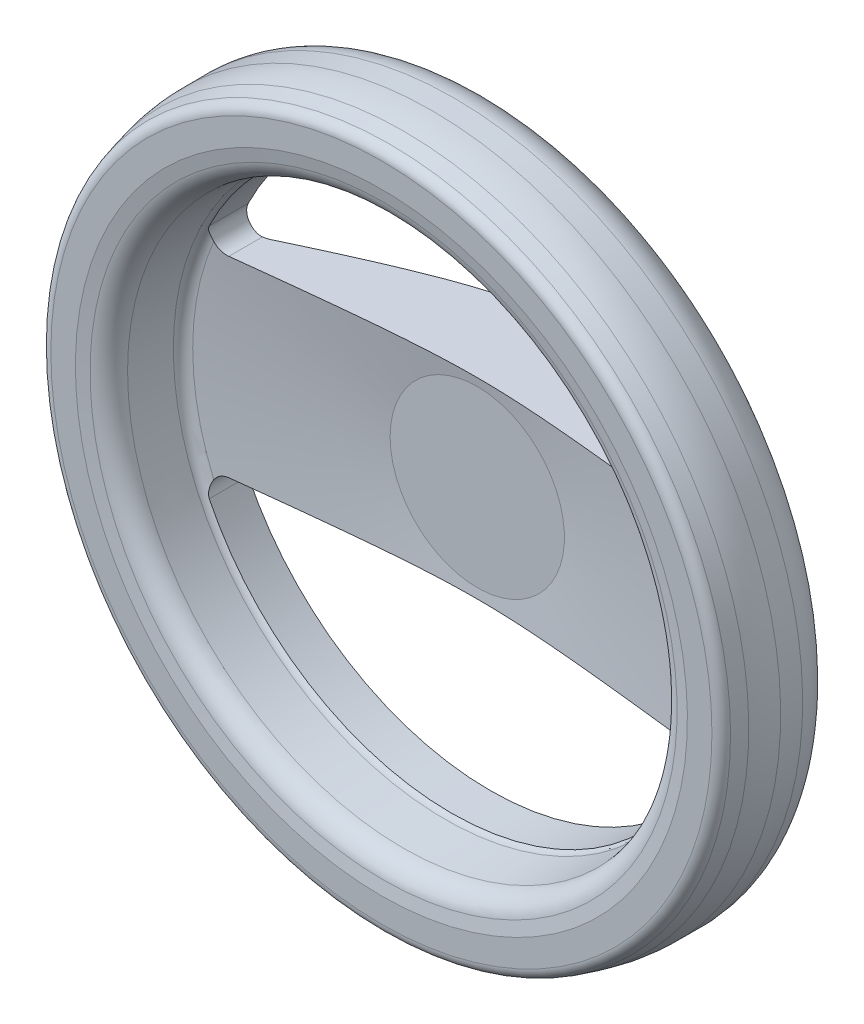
ISO-10303-21;
HEADER;
FILE_DESCRIPTION(('STEP AP214'),'2;1');
FILE_NAME('part.step','',(''),(''),'','','');
FILE_SCHEMA(('AUTOMOTIVE_DESIGN { 1 0 10303 214 1 1 1 1 }'));
ENDSEC;
DATA;
#1=APPLICATION_CONTEXT('core data for automotive mechanical design processes');
#2=APPLICATION_PROTOCOL_DEFINITION('international standard','automotive_design',2000,#1);
#3=PRODUCT_CONTEXT('',#1,'mechanical');
#4=PRODUCT('Part','Part','',(#3));
#5=PRODUCT_RELATED_PRODUCT_CATEGORY('part','',(#4));
#6=PRODUCT_DEFINITION_FORMATION('','',#4);
#7=PRODUCT_DEFINITION_CONTEXT('part definition',#1,'design');
#8=PRODUCT_DEFINITION('design','',#6,#7);
#9=PRODUCT_DEFINITION_SHAPE('','',#8);
#10=(LENGTH_UNIT() NAMED_UNIT(*) SI_UNIT(.MILLI.,.METRE.));
#11=(NAMED_UNIT(*) PLANE_ANGLE_UNIT() SI_UNIT($,.RADIAN.));
#12=(NAMED_UNIT(*) SI_UNIT($,.STERADIAN.) SOLID_ANGLE_UNIT());
#13=UNCERTAINTY_MEASURE_WITH_UNIT(LENGTH_MEASURE(1.E-05),#10,'distance_accuracy_value','');
#14=(GEOMETRIC_REPRESENTATION_CONTEXT(3) GLOBAL_UNCERTAINTY_ASSIGNED_CONTEXT((#13)) GLOBAL_UNIT_ASSIGNED_CONTEXT((#10,
#11,#12)) REPRESENTATION_CONTEXT('',''));
#15=CARTESIAN_POINT('',(0.,0.,0.));
#16=DIRECTION('',(0.,0.,1.));
#17=DIRECTION('',(1.,0.,0.));
#18=AXIS2_PLACEMENT_3D('',#15,#16,#17);
#19=CARTESIAN_POINT('',(-3.75,0.,27.));
#20=DIRECTION('',(0.,0.,-1.));
#21=DIRECTION('',(0.,1.,0.));
#22=AXIS2_PLACEMENT_3D('',#19,#20,#21);
#23=PLANE('',#22);
#24=CARTESIAN_POINT('',(0.,0.,27.));
#25=DIRECTION('',(0.,0.,1.));
#26=DIRECTION('',(0.,-1.,0.));
#27=AXIS2_PLACEMENT_3D('',#24,#25,#26);
#28=CIRCLE('',#27,7.5);
#29=CARTESIAN_POINT('',(0.,-7.5,27.));
#30=VERTEX_POINT('',#29);
#31=EDGE_CURVE('E580',#30,#30,#28,.F.);
#32=ORIENTED_EDGE('',*,*,#31,.T.);
#33=EDGE_LOOP('',(#32));
#34=FACE_BOUND('',#33,.T.);
#35=ADVANCED_FACE('F14',(#34),#23,.T.);
#36=CARTESIAN_POINT('',(0.,0.,27.));
#37=DIRECTION('',(0.,0.,1.));
#38=DIRECTION('',(0.,-1.,0.));
#39=AXIS2_PLACEMENT_3D('',#36,#37,#38);
#40=CONICAL_SURFACE('',#39,7.5,0.785398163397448);
#41=ORIENTED_EDGE('',*,*,#31,.F.);
#42=EDGE_LOOP('',(#41));
#43=FACE_BOUND('',#42,.T.);
#44=CARTESIAN_POINT('',(0.,0.,26.5));
#45=DIRECTION('',(0.,0.,1.));
#46=DIRECTION('',(-1.,0.,0.));
#47=AXIS2_PLACEMENT_3D('',#44,#45,#46);
#48=CIRCLE('',#47,7.);
#49=CARTESIAN_POINT('',(-7.,0.,26.5));
#50=VERTEX_POINT('',#49);
#51=EDGE_CURVE('E582',#50,#50,#48,.F.);
#52=ORIENTED_EDGE('',*,*,#51,.T.);
#53=EDGE_LOOP('',(#52));
#54=FACE_BOUND('',#53,.T.);
#55=ADVANCED_FACE('F908',(#43,#54),#40,.F.);
#56=CARTESIAN_POINT('',(0.,0.,13.35));
#57=DIRECTION('',(0.,0.,1.));
#58=DIRECTION('',(-1.,0.,0.));
#59=AXIS2_PLACEMENT_3D('',#56,#57,#58);
#60=CYLINDRICAL_SURFACE('',#59,7.);
#61=ORIENTED_EDGE('',*,*,#51,.F.);
#62=EDGE_LOOP('',(#61));
#63=FACE_BOUND('',#62,.T.);
#64=CARTESIAN_POINT('',(0.,0.,0.2));
#65=DIRECTION('',(0.,0.,-1.));
#66=DIRECTION('',(-1.,0.,0.));
#67=AXIS2_PLACEMENT_3D('',#64,#65,#66);
#68=CIRCLE('',#67,7.);
#69=CARTESIAN_POINT('',(-7.,0.,0.2));
#70=VERTEX_POINT('',#69);
#71=EDGE_CURVE('E579',#70,#70,#68,.T.);
#72=ORIENTED_EDGE('',*,*,#71,.T.);
#73=EDGE_LOOP('',(#72));
#74=FACE_BOUND('',#73,.T.);
#75=ADVANCED_FACE('F899',(#63,#74),#60,.F.);
#76=CARTESIAN_POINT('',(0.,0.,0.));
#77=DIRECTION('',(0.,0.,-1.));
#78=DIRECTION('',(1.,0.,0.));
#79=AXIS2_PLACEMENT_3D('',#76,#77,#78);
#80=CONICAL_SURFACE('',#79,7.2,0.78539816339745);
#81=ORIENTED_EDGE('',*,*,#71,.F.);
#82=EDGE_LOOP('',(#81));
#83=FACE_BOUND('',#82,.T.);
#84=CARTESIAN_POINT('',(0.,0.,0.));
#85=DIRECTION('',(0.,0.,-1.));
#86=DIRECTION('',(1.,0.,0.));
#87=AXIS2_PLACEMENT_3D('',#84,#85,#86);
#88=CIRCLE('',#87,7.2);
#89=CARTESIAN_POINT('',(7.2,0.,0.));
#90=VERTEX_POINT('',#89);
#91=EDGE_CURVE('E576',#90,#90,#88,.F.);
#92=ORIENTED_EDGE('',*,*,#91,.F.);
#93=EDGE_LOOP('',(#92));
#94=FACE_BOUND('',#93,.T.);
#95=ADVANCED_FACE('F891',(#83,#94),#80,.F.);
#96=CARTESIAN_POINT('',(-10.1,0.,0.));
#97=DIRECTION('',(0.,0.,-1.));
#98=DIRECTION('',(0.,1.,0.));
#99=AXIS2_PLACEMENT_3D('',#96,#97,#98);
#100=PLANE('',#99);
#101=CARTESIAN_POINT('',(0.,0.,0.));
#102=DIRECTION('',(0.,0.,1.));
#103=DIRECTION('',(-1.,0.,0.));
#104=AXIS2_PLACEMENT_3D('',#101,#102,#103);
#105=CIRCLE('',#104,13.);
#106=CARTESIAN_POINT('',(-13.,0.,0.));
#107=VERTEX_POINT('',#106);
#108=EDGE_CURVE('E570',#107,#107,#105,.T.);
#109=ORIENTED_EDGE('',*,*,#108,.F.);
#110=EDGE_LOOP('',(#109));
#111=FACE_BOUND('',#110,.T.);
#112=ORIENTED_EDGE('',*,*,#91,.T.);
#113=EDGE_LOOP('',(#112));
#114=FACE_BOUND('',#113,.T.);
#115=ADVANCED_FACE('F883',(#111,#114),#100,.T.);
#116=CARTESIAN_POINT('',(0.,0.,0.1));
#117=DIRECTION('',(0.,0.,1.));
#118=DIRECTION('',(-1.,0.,0.));
#119=AXIS2_PLACEMENT_3D('',#116,#117,#118);
#120=CYLINDRICAL_SURFACE('',#119,13.);
#121=ORIENTED_EDGE('',*,*,#108,.T.);
#122=EDGE_LOOP('',(#121));
#123=FACE_BOUND('',#122,.T.);
#124=CARTESIAN_POINT('',(0.,0.,0.2));
#125=DIRECTION('',(0.,0.,1.));
#126=DIRECTION('',(-1.,0.,0.));
#127=AXIS2_PLACEMENT_3D('',#124,#125,#126);
#128=CIRCLE('',#127,13.);
#129=CARTESIAN_POINT('',(-13.,0.,0.2));
#130=VERTEX_POINT('',#129);
#131=EDGE_CURVE('E563',#130,#130,#128,.T.);
#132=ORIENTED_EDGE('',*,*,#131,.F.);
#133=EDGE_LOOP('',(#132));
#134=FACE_BOUND('',#133,.T.);
#135=ADVANCED_FACE('F467',(#123,#134),#120,.T.);
#136=CARTESIAN_POINT('',(-73.0354974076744,0.,51.));
#137=DIRECTION('',(0.,0.,1.));
#138=DIRECTION('',(-1.,0.,0.));
#139=AXIS2_PLACEMENT_3D('',#136,#137,#138);
#140=PLANE('',#139);
#141=CARTESIAN_POINT('',(0.,0.,51.));
#142=DIRECTION('',(0.,0.,1.));
#143=DIRECTION('',(0.,-1.,0.));
#144=AXIS2_PLACEMENT_3D('',#141,#142,#143);
#145=CIRCLE('',#144,70.2222222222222);
#146=CARTESIAN_POINT('',(0.,-70.2222222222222,51.));
#147=VERTEX_POINT('',#146);
#148=EDGE_CURVE('E565',#147,#147,#145,.F.);
#149=ORIENTED_EDGE('',*,*,#148,.T.);
#150=EDGE_LOOP('',(#149));
#151=FACE_BOUND('',#150,.T.);
#152=CARTESIAN_POINT('',(0.,0.,51.));
#153=DIRECTION('',(0.,0.,-1.));
#154=DIRECTION('',(0.,-1.,0.));
#155=AXIS2_PLACEMENT_3D('',#152,#153,#154);
#156=CIRCLE('',#155,75.8487725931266);
#157=CARTESIAN_POINT('',(0.,-75.8487725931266,51.));
#158=VERTEX_POINT('',#157);
#159=CARTESIAN_POINT('',(-75.8487725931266,0.,51.));
#160=VERTEX_POINT('',#159);
#161=EDGE_CURVE('E562',#158,#160,#156,.T.);
#162=ORIENTED_EDGE('',*,*,#161,.F.);
#163=CARTESIAN_POINT('',(0.,0.,51.));
#164=DIRECTION('',(0.,0.,-1.));
#165=DIRECTION('',(0.,1.,0.));
#166=AXIS2_PLACEMENT_3D('',#163,#164,#165);
#167=CIRCLE('',#166,75.8487725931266);
#168=CARTESIAN_POINT('',(0.,75.8487725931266,51.));
#169=VERTEX_POINT('',#168);
#170=EDGE_CURVE('E482',#169,#158,#167,.T.);
#171=ORIENTED_EDGE('',*,*,#170,.F.);
#172=CARTESIAN_POINT('',(0.,0.,51.));
#173=DIRECTION('',(0.,0.,-1.));
#174=DIRECTION('',(-1.,0.,0.));
#175=AXIS2_PLACEMENT_3D('',#172,#173,#174);
#176=CIRCLE('',#175,75.8487725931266);
#177=EDGE_CURVE('E445',#160,#169,#176,.T.);
#178=ORIENTED_EDGE('',*,*,#177,.F.);
#179=EDGE_LOOP('',(#162,#171,#178));
#180=FACE_BOUND('',#179,.T.);
#181=ADVANCED_FACE('F456',(#151,#180),#140,.T.);
#182=CARTESIAN_POINT('',(0.,0.,51.));
#183=DIRECTION('',(0.,0.,1.));
#184=DIRECTION('',(0.,-1.,0.));
#185=AXIS2_PLACEMENT_3D('',#182,#183,#184);
#186=CONICAL_SURFACE('',#185,70.2222222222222,1.39626340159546);
#187=CARTESIAN_POINT('',(0.,0.,50.4946455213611));
#188=DIRECTION('',(0.,0.,-1.));
#189=DIRECTION('',(0.,1.,0.));
#190=AXIS2_PLACEMENT_3D('',#187,#188,#189);
#191=CIRCLE('',#190,67.356214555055);
#192=CARTESIAN_POINT('',(0.,67.356214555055,50.4946455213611));
#193=VERTEX_POINT('',#192);
#194=EDGE_CURVE('E436',#193,#193,#191,.F.);
#195=ORIENTED_EDGE('',*,*,#194,.F.);
#196=EDGE_LOOP('',(#195));
#197=FACE_BOUND('',#196,.T.);
#198=ORIENTED_EDGE('',*,*,#148,.F.);
#199=EDGE_LOOP('',(#198));
#200=FACE_BOUND('',#199,.T.);
#201=ADVANCED_FACE('F466',(#197,#200),#186,.F.);
#202=CARTESIAN_POINT('',(-16.25,0.,0.2));
#203=DIRECTION('',(0.,0.,-1.));
#204=DIRECTION('',(0.,1.,0.));
#205=AXIS2_PLACEMENT_3D('',#202,#203,#204);
#206=PLANE('',#205);
#207=CARTESIAN_POINT('',(0.,0.,0.2));
#208=DIRECTION('',(0.,0.,1.));
#209=DIRECTION('',(0.,-1.,0.));
#210=AXIS2_PLACEMENT_3D('',#207,#208,#209);
#211=CIRCLE('',#210,19.5);
#212=CARTESIAN_POINT('',(0.,-19.5,0.2));
#213=VERTEX_POINT('',#212);
#214=CARTESIAN_POINT('',(0.,19.5,0.2));
#215=VERTEX_POINT('',#214);
#216=EDGE_CURVE('E444',#213,#215,#211,.T.);
#217=ORIENTED_EDGE('',*,*,#216,.F.);
#218=CARTESIAN_POINT('',(0.,0.,0.2));
#219=DIRECTION('',(0.,0.,1.));
#220=DIRECTION('',(-1.,0.,0.));
#221=AXIS2_PLACEMENT_3D('',#218,#219,#220);
#222=CIRCLE('',#221,19.5);
#223=CARTESIAN_POINT('',(-19.5,0.,0.2));
#224=VERTEX_POINT('',#223);
#225=EDGE_CURVE('E518',#224,#213,#222,.T.);
#226=ORIENTED_EDGE('',*,*,#225,.F.);
#227=CARTESIAN_POINT('',(0.,0.,0.2));
#228=DIRECTION('',(0.,0.,1.));
#229=DIRECTION('',(0.,1.,0.));
#230=AXIS2_PLACEMENT_3D('',#227,#228,#229);
#231=CIRCLE('',#230,19.5);
#232=EDGE_CURVE('E522',#215,#224,#231,.T.);
#233=ORIENTED_EDGE('',*,*,#232,.F.);
#234=EDGE_LOOP('',(#217,#226,#233));
#235=FACE_BOUND('',#234,.T.);
#236=ORIENTED_EDGE('',*,*,#131,.T.);
#237=EDGE_LOOP('',(#236));
#238=FACE_BOUND('',#237,.T.);
#239=ADVANCED_FACE('F506',(#235,#238),#206,.T.);
#240=CARTESIAN_POINT('',(0.,0.,48.5));
#241=DIRECTION('',(0.,0.,-1.));
#242=DIRECTION('',(0.,1.,0.));
#243=AXIS2_PLACEMENT_3D('',#240,#241,#242);
#244=TOROIDAL_SURFACE('',#243,75.8487725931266,2.5);
#245=CARTESIAN_POINT('',(0.,0.,49.1470476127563));
#246=DIRECTION('',(0.,0.,-1.));
#247=DIRECTION('',(-1.,0.,0.));
#248=AXIS2_PLACEMENT_3D('',#245,#246,#247);
#249=CIRCLE('',#248,78.2635871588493);
#250=CARTESIAN_POINT('',(-78.2635871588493,0.,49.1470476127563));
#251=VERTEX_POINT('',#250);
#252=EDGE_CURVE('E514',#251,#251,#249,.T.);
#253=ORIENTED_EDGE('',*,*,#252,.F.);
#254=EDGE_LOOP('',(#253));
#255=FACE_BOUND('',#254,.T.);
#256=ORIENTED_EDGE('',*,*,#161,.T.);
#257=ORIENTED_EDGE('',*,*,#177,.T.);
#258=ORIENTED_EDGE('',*,*,#170,.T.);
#259=EDGE_LOOP('',(#256,#257,#258));
#260=FACE_BOUND('',#259,.T.);
#261=ADVANCED_FACE('F497',(#255,#260),#244,.T.);
#262=CARTESIAN_POINT('',(0.,0.,45.5706067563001));
#263=DIRECTION('',(0.,0.,-1.));
#264=DIRECTION('',(0.,1.,0.));
#265=AXIS2_PLACEMENT_3D('',#262,#263,#264);
#266=TOROIDAL_SURFACE('',#265,68.2244554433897,5.);
#267=CARTESIAN_POINT('',(0.,0.,46.0063854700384));
#268=DIRECTION('',(0.,0.,1.));
#269=DIRECTION('',(-1.,0.,0.));
#270=AXIS2_PLACEMENT_3D('',#267,#268,#269);
#271=CIRCLE('',#270,63.243481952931);
#272=CARTESIAN_POINT('',(-63.243481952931,0.,46.0063854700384));
#273=VERTEX_POINT('',#272);
#274=EDGE_CURVE('E517',#273,#273,#271,.F.);
#275=ORIENTED_EDGE('',*,*,#274,.T.);
#276=EDGE_LOOP('',(#275));
#277=FACE_BOUND('',#276,.T.);
#278=ORIENTED_EDGE('',*,*,#194,.T.);
#279=EDGE_LOOP('',(#278));
#280=FACE_BOUND('',#279,.T.);
#281=ADVANCED_FACE('F419',(#277,#280),#266,.T.);
#282=CARTESIAN_POINT('',(0.,0.,0.7));
#283=DIRECTION('',(0.,0.,-1.));
#284=DIRECTION('',(0.,1.,0.));
#285=AXIS2_PLACEMENT_3D('',#282,#283,#284);
#286=TOROIDAL_SURFACE('',#285,19.5,0.5);
#287=ORIENTED_EDGE('',*,*,#216,.T.);
#288=ORIENTED_EDGE('',*,*,#232,.T.);
#289=ORIENTED_EDGE('',*,*,#225,.T.);
#290=EDGE_LOOP('',(#287,#288,#289));
#291=FACE_BOUND('',#290,.T.);
#292=CARTESIAN_POINT('',(0.,0.,0.7));
#293=DIRECTION('',(0.,0.,1.));
#294=DIRECTION('',(-1.,0.,0.));
#295=AXIS2_PLACEMENT_3D('',#292,#293,#294);
#296=CIRCLE('',#295,20.);
#297=CARTESIAN_POINT('',(-20.,0.,0.7));
#298=VERTEX_POINT('',#297);
#299=EDGE_CURVE('E408',#298,#298,#296,.T.);
#300=ORIENTED_EDGE('',*,*,#299,.F.);
#301=EDGE_LOOP('',(#300));
#302=FACE_BOUND('',#301,.T.);
#303=ADVANCED_FACE('F413',(#291,#302),#286,.T.);
#304=CARTESIAN_POINT('',(0.,0.,45.8458303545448));
#305=DIRECTION('',(0.,0.,-1.));
#306=DIRECTION('',(1.,0.,0.));
#307=AXIS2_PLACEMENT_3D('',#304,#305,#306);
#308=CONICAL_SURFACE('',#307,79.1481456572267,0.261799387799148);
#309=CARTESIAN_POINT('',(0.,0.,45.8458303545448));
#310=DIRECTION('',(0.,0.,-1.));
#311=DIRECTION('',(0.,1.,0.));
#312=AXIS2_PLACEMENT_3D('',#309,#310,#311);
#313=CIRCLE('',#312,79.1481456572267);
#314=CARTESIAN_POINT('',(0.,79.1481456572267,45.8458303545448));
#315=VERTEX_POINT('',#314);
#316=EDGE_CURVE('E391',#315,#315,#313,.T.);
#317=ORIENTED_EDGE('',*,*,#316,.F.);
#318=EDGE_LOOP('',(#317));
#319=FACE_BOUND('',#318,.T.);
#320=ORIENTED_EDGE('',*,*,#252,.T.);
#321=EDGE_LOOP('',(#320));
#322=FACE_BOUND('',#321,.T.);
#323=ADVANCED_FACE('F418',(#319,#322),#308,.T.);
#324=CARTESIAN_POINT('',(-10.,0.,29.));
#325=DIRECTION('',(0.,0.,1.));
#326=DIRECTION('',(-1.,0.,0.));
#327=AXIS2_PLACEMENT_3D('',#324,#325,#326);
#328=PLANE('',#327);
#329=CARTESIAN_POINT('',(0.,0.,29.));
#330=DIRECTION('',(0.,0.,1.));
#331=DIRECTION('',(-1.,0.,0.));
#332=AXIS2_PLACEMENT_3D('',#329,#330,#331);
#333=CIRCLE('',#332,20.);
#334=CARTESIAN_POINT('',(-20.,0.,29.));
#335=VERTEX_POINT('',#334);
#336=EDGE_CURVE('E390',#335,#335,#333,.T.);
#337=ORIENTED_EDGE('',*,*,#336,.T.);
#338=EDGE_LOOP('',(#337));
#339=FACE_BOUND('',#338,.T.);
#340=ADVANCED_FACE('F731',(#339),#328,.T.);
#341=CARTESIAN_POINT('',(0.,0.,46.0063854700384));
#342=DIRECTION('',(0.,0.,1.));
#343=DIRECTION('',(-1.,0.,0.));
#344=AXIS2_PLACEMENT_3D('',#341,#342,#343);
#345=CONICAL_SURFACE('',#344,63.243481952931,0.0872664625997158);
#346=CARTESIAN_POINT('',(0.,0.,36.3429303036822));
#347=DIRECTION('',(0.,0.,-1.));
#348=DIRECTION('',(0.,1.,0.));
#349=AXIS2_PLACEMENT_3D('',#346,#347,#348);
#350=CIRCLE('',#349,62.3980391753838);
#351=CARTESIAN_POINT('',(0.,62.3980391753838,36.3429303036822));
#352=VERTEX_POINT('',#351);
#353=EDGE_CURVE('E382',#352,#352,#350,.T.);
#354=ORIENTED_EDGE('',*,*,#353,.T.);
#355=EDGE_LOOP('',(#354));
#356=FACE_BOUND('',#355,.T.);
#357=ORIENTED_EDGE('',*,*,#274,.F.);
#358=EDGE_LOOP('',(#357));
#359=FACE_BOUND('',#358,.T.);
#360=ADVANCED_FACE('F727',(#356,#359),#345,.F.);
#361=CARTESIAN_POINT('',(0.,0.,3.975));
#362=DIRECTION('',(0.,0.,1.));
#363=DIRECTION('',(-1.,0.,0.));
#364=AXIS2_PLACEMENT_3D('',#361,#362,#363);
#365=CYLINDRICAL_SURFACE('',#364,20.);
#366=CARTESIAN_POINT('',(0.,0.,7.25));
#367=DIRECTION('',(0.,0.,1.));
#368=DIRECTION('',(-1.,0.,0.));
#369=AXIS2_PLACEMENT_3D('',#366,#367,#368);
#370=CIRCLE('',#369,20.);
#371=CARTESIAN_POINT('',(-20.,0.,7.25));
#372=VERTEX_POINT('',#371);
#373=EDGE_CURVE('E160',#372,#372,#370,.T.);
#374=ORIENTED_EDGE('',*,*,#373,.F.);
#375=EDGE_LOOP('',(#374));
#376=FACE_BOUND('',#375,.T.);
#377=ORIENTED_EDGE('',*,*,#299,.T.);
#378=EDGE_LOOP('',(#377));
#379=FACE_BOUND('',#378,.T.);
#380=ADVANCED_FACE('F730',(#376,#379),#365,.T.);
#381=CARTESIAN_POINT('',(0.,0.,39.3753542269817));
#382=DIRECTION('',(0.,0.,-1.));
#383=DIRECTION('',(0.,1.,0.));
#384=AXIS2_PLACEMENT_3D('',#381,#382,#383);
#385=TOROIDAL_SURFACE('',#384,55.,25.0000000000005);
#386=ORIENTED_EDGE('',*,*,#316,.T.);
#387=EDGE_LOOP('',(#386));
#388=FACE_BOUND('',#387,.T.);
#389=CARTESIAN_POINT('',(0.,0.,39.3753542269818));
#390=DIRECTION('',(0.,0.,1.));
#391=DIRECTION('',(-1.,0.,0.));
#392=AXIS2_PLACEMENT_3D('',#389,#390,#391);
#393=CIRCLE('',#392,80.);
#394=CARTESIAN_POINT('',(-80.,0.,39.3753542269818));
#395=VERTEX_POINT('',#394);
#396=EDGE_CURVE('E318',#395,#395,#393,.F.);
#397=ORIENTED_EDGE('',*,*,#396,.F.);
#398=EDGE_LOOP('',(#397));
#399=FACE_BOUND('',#398,.T.);
#400=ADVANCED_FACE('F335',(#388,#399),#385,.T.);
#401=CARTESIAN_POINT('',(0.,0.,34.0805287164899));
#402=DIRECTION('',(0.,0.,1.));
#403=DIRECTION('',(-1.,0.,0.));
#404=AXIS2_PLACEMENT_3D('',#401,#402,#403);
#405=CONICAL_SURFACE('',#404,60.220852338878,1.44514599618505);
#406=ORIENTED_EDGE('',*,*,#336,.F.);
#407=EDGE_LOOP('',(#406));
#408=FACE_BOUND('',#407,.T.);
#409=CARTESIAN_POINT('',(52.3588311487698,-22.,33.6475394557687));
#410=CARTESIAN_POINT('',(52.4596888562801,-21.9999905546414,33.6592844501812));
#411=CARTESIAN_POINT('',(52.5605165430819,-22.0042913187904,33.6712415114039));
#412=CARTESIAN_POINT('',(52.7613978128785,-22.021427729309,33.6954876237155));
#413=CARTESIAN_POINT('',(52.8614514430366,-22.0342628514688,33.7077766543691));
#414=CARTESIAN_POINT('',(53.0599442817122,-22.0683586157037,33.7325786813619));
#415=CARTESIAN_POINT('',(53.1583855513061,-22.0896074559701,33.745091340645));
#416=CARTESIAN_POINT('',(53.3530716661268,-22.1403554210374,33.7702613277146));
#417=CARTESIAN_POINT('',(53.4493165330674,-22.169854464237,33.782918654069));
#418=CARTESIAN_POINT('',(53.7338604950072,-22.2704851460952,33.8209884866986));
#419=CARTESIAN_POINT('',(53.9180045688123,-22.3537564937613,33.8465033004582));
#420=CARTESIAN_POINT('',(54.2695765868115,-22.5502969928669,33.8970368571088));
#421=CARTESIAN_POINT('',(54.4370061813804,-22.663563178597,33.9220556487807));
#422=CARTESIAN_POINT('',(54.6700861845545,-22.8518947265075,33.9583895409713));
#423=CARTESIAN_POINT('',(54.7440021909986,-22.9168774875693,33.9701701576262));
#424=CARTESIAN_POINT('',(54.8862417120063,-23.0527899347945,33.9933782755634));
#425=CARTESIAN_POINT('',(54.9545653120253,-23.1237195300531,34.0048057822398));
#426=CARTESIAN_POINT('',(55.0852101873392,-23.2711417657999,34.0272465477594));
#427=CARTESIAN_POINT('',(55.1475228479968,-23.3476421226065,34.0382591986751));
#428=CARTESIAN_POINT('',(55.2656184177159,-23.5056032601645,34.0597855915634));
#429=CARTESIAN_POINT('',(55.3214007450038,-23.5870644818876,34.0702992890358));
#430=CARTESIAN_POINT('',(55.373703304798,-23.6707422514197,34.0805287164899));
#431=B_SPLINE_CURVE_WITH_KNOTS('',3,(#409,#410,#411,#412,#413,#414,#415,#416,#417,#418,#419,
#420,#421,#422,#423,#424,#425,#426,#427,#428,#429,#430),.UNSPECIFIED.,.F.,.F.,(4,2,2,2,2,2,2,2,
2,2,4),(0.,0.304517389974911,0.60901607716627,0.913089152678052,1.21715922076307,
1.82519148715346,2.43316365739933,2.73025017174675,3.0273321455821,3.32483374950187,
3.62236183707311),.UNSPECIFIED.);
#432=CARTESIAN_POINT('',(52.3588311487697,-22.,33.6475394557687));
#433=VERTEX_POINT('',#432);
#434=CARTESIAN_POINT('',(55.373703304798,-23.6707422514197,34.0805287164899));
#435=VERTEX_POINT('',#434);
#436=EDGE_CURVE('E341',#433,#435,#431,.T.);
#437=ORIENTED_EDGE('',*,*,#436,.T.);
#438=CARTESIAN_POINT('',(0.,0.,34.0805287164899));
#439=DIRECTION('',(0.,0.,1.));
#440=DIRECTION('',(-1.,0.,0.));
#441=AXIS2_PLACEMENT_3D('',#438,#439,#440);
#442=CIRCLE('',#441,60.220852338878);
#443=CARTESIAN_POINT('',(55.373703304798,23.6707422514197,34.0805287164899));
#444=VERTEX_POINT('',#443);
#445=EDGE_CURVE('E388',#444,#435,#442,.F.);
#446=ORIENTED_EDGE('',*,*,#445,.F.);
#447=CARTESIAN_POINT('',(55.373703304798,23.6707422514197,34.0805287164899));
#448=CARTESIAN_POINT('',(55.3202863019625,23.5852802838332,34.070081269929));
#449=CARTESIAN_POINT('',(55.2632388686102,23.5021308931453,34.0593372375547));
#450=CARTESIAN_POINT('',(55.1423401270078,23.3410176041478,34.0373300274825));
#451=CARTESIAN_POINT('',(55.0784893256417,23.2630533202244,34.026066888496));
#452=CARTESIAN_POINT('',(54.94453851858,23.1129761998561,34.0031120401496));
#453=CARTESIAN_POINT('',(54.8744485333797,23.0408543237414,33.9914210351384));
#454=CARTESIAN_POINT('',(54.7284708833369,22.9028431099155,33.9676759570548));
#455=CARTESIAN_POINT('',(54.6525832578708,22.8369537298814,33.9556218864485));
#456=CARTESIAN_POINT('',(54.4169216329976,22.6492677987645,33.9190197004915));
#457=CARTESIAN_POINT('',(54.2491153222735,22.5374159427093,33.8940258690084));
#458=CARTESIAN_POINT('',(53.8970762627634,22.3436800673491,33.8435738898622));
#459=CARTESIAN_POINT('',(53.7128434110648,22.2617962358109,33.8181157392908));
#460=CARTESIAN_POINT('',(53.4298743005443,22.163708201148,33.7803527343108));
#461=CARTESIAN_POINT('',(53.3352395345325,22.1352682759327,33.7679345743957));
#462=CARTESIAN_POINT('',(53.1438913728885,22.0863486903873,33.7432427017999));
#463=CARTESIAN_POINT('',(53.0471779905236,22.0658689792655,33.730968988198));
#464=CARTESIAN_POINT('',(52.8522324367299,22.0330119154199,33.7066410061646));
#465=CARTESIAN_POINT('',(52.7539984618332,22.0206450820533,33.6945870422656));
#466=CARTESIAN_POINT('',(52.5567963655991,22.004134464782,33.6708004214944));
#467=CARTESIAN_POINT('',(52.4578281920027,21.9999912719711,33.6590677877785));
#468=CARTESIAN_POINT('',(52.3588311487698,22.,33.6475394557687));
#469=B_SPLINE_CURVE_WITH_KNOTS('',3,(#447,#448,#449,#450,#451,#452,#453,#454,#455,#456,#457,
#458,#459,#460,#461,#462,#463,#464,#465,#466,#467,#468),.UNSPECIFIED.,.F.,.F.,(4,2,2,2,2,2,2,2,
2,2,4),(0.,0.303866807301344,0.607710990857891,0.911075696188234,1.21443834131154,
1.82101357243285,2.42759260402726,2.72608977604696,3.02458504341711,3.3234665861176,
3.62236961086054),.UNSPECIFIED.);
#470=CARTESIAN_POINT('',(52.3588311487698,22.,33.6475394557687));
#471=VERTEX_POINT('',#470);
#472=EDGE_CURVE('E238',#444,#471,#469,.T.);
#473=ORIENTED_EDGE('',*,*,#472,.T.);
#474=CARTESIAN_POINT('',(52.3588311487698,22.,33.6475394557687));
#475=CARTESIAN_POINT('',(51.2622023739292,22.,33.5198422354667));
#476=CARTESIAN_POINT('',(50.1655060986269,22.,33.3927217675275));
#477=CARTESIAN_POINT('',(47.9719504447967,22.,33.1398850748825));
#478=CARTESIAN_POINT('',(46.8750910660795,22.,33.014168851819));
#479=CARTESIAN_POINT('',(44.6811586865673,22.,32.7643888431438));
#480=CARTESIAN_POINT('',(43.5840856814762,22.,32.6403250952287));
#481=CARTESIAN_POINT('',(41.3897171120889,22.,32.3941821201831));
#482=CARTESIAN_POINT('',(40.292421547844,22.,32.2721028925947));
#483=CARTESIAN_POINT('',(38.0940121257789,22.,32.0299470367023));
#484=CARTESIAN_POINT('',(36.9928974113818,22.,31.9098781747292));
#485=CARTESIAN_POINT('',(34.7903519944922,22.,31.6726757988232));
#486=CARTESIAN_POINT('',(33.688921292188,22.,31.5555422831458));
#487=CARTESIAN_POINT('',(31.4856830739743,22.,31.3248817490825));
#488=CARTESIAN_POINT('',(30.383875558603,22.,31.2113547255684));
#489=CARTESIAN_POINT('',(28.1798077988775,22.,30.9887681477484));
#490=CARTESIAN_POINT('',(27.0775475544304,22.,30.8797085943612));
#491=CARTESIAN_POINT('',(24.8810672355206,22.,30.6679913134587));
#492=CARTESIAN_POINT('',(23.7868513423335,22.,30.5652903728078));
#493=CARTESIAN_POINT('',(21.5977924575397,22.,30.3667606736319));
#494=CARTESIAN_POINT('',(20.5029494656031,22.,30.2709319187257));
#495=CARTESIAN_POINT('',(18.3124889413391,22.,30.0878891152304));
#496=CARTESIAN_POINT('',(17.2168713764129,22.,30.0006754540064));
#497=CARTESIAN_POINT('',(15.0248237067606,22.,29.8370159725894));
#498=CARTESIAN_POINT('',(13.9283936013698,22.,29.7605701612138));
#499=CARTESIAN_POINT('',(11.7365940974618,22.,29.6210865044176));
#500=CARTESIAN_POINT('',(10.6412261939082,22.,29.5580254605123));
#501=CARTESIAN_POINT('',(8.44969202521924,22.,29.4478453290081));
#502=CARTESIAN_POINT('',(7.3535257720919,22.,29.4007260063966));
#503=CARTESIAN_POINT('',(5.16069259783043,22.,29.3249590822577));
#504=CARTESIAN_POINT('',(4.06402576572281,22.,29.2963089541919));
#505=CARTESIAN_POINT('',(1.87034817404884,22.,29.2592768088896));
#506=CARTESIAN_POINT('',(0.773337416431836,22.,29.2508946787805));
#507=CARTESIAN_POINT('',(-1.40726476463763,22.,29.2549450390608));
#508=CARTESIAN_POINT('',(-2.49085667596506,22.,29.2671249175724));
#509=CARTESIAN_POINT('',(-4.6576424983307,22.,29.3110112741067));
#510=CARTESIAN_POINT('',(-5.74083640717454,22.,29.3427178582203));
#511=CARTESIAN_POINT('',(-7.90670068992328,22.,29.4237590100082));
#512=CARTESIAN_POINT('',(-8.98937097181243,22.,29.4730959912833));
#513=CARTESIAN_POINT('',(-11.1539188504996,22.,29.5869023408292));
#514=CARTESIAN_POINT('',(-12.2357964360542,22.,29.6513719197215));
#515=CARTESIAN_POINT('',(-14.4005997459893,22.,29.792973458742));
#516=CARTESIAN_POINT('',(-15.4835240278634,22.,29.8701272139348));
#517=CARTESIAN_POINT('',(-17.648589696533,22.,30.0346352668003));
#518=CARTESIAN_POINT('',(-18.7307310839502,22.,30.1219895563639));
#519=CARTESIAN_POINT('',(-20.8942642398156,22.,30.3048739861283));
#520=CARTESIAN_POINT('',(-21.9756560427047,22.,30.4004037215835));
#521=CARTESIAN_POINT('',(-24.1378385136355,22.,30.5980029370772));
#522=CARTESIAN_POINT('',(-25.2186291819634,22.,30.7000724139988));
#523=CARTESIAN_POINT('',(-27.3880721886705,22.,30.9102617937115));
#524=CARTESIAN_POINT('',(-28.4767205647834,22.,31.0184224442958));
#525=CARTESIAN_POINT('',(-30.6535823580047,22.,31.2390218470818));
#526=CARTESIAN_POINT('',(-31.7417957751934,22.,31.3514605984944));
#527=CARTESIAN_POINT('',(-33.9178632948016,22.,31.5798033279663));
#528=CARTESIAN_POINT('',(-35.0057173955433,22.,31.6957073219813));
#529=CARTESIAN_POINT('',(-37.1811206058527,22.,31.9303441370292));
#530=CARTESIAN_POINT('',(-38.26866971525,22.,32.0490769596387));
#531=CARTESIAN_POINT('',(-40.4400812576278,22.,32.2884933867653));
#532=CARTESIAN_POINT('',(-41.523944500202,22.,32.4091696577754));
#533=CARTESIAN_POINT('',(-43.691455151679,22.,32.6524456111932));
#534=CARTESIAN_POINT('',(-44.7751025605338,22.,32.7750452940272));
#535=CARTESIAN_POINT('',(-46.9421872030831,22.,33.0218499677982));
#536=CARTESIAN_POINT('',(-48.0256244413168,22.,33.1460549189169));
#537=CARTESIAN_POINT('',(-50.1923401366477,22.,33.3958320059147));
#538=CARTESIAN_POINT('',(-51.2756185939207,22.,33.5214041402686));
#539=CARTESIAN_POINT('',(-52.3588311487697,22.,33.6475394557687));
#540=B_SPLINE_CURVE_WITH_KNOTS('',3,(#474,#475,#476,#477,#478,#479,#480,#481,#482,#483,#484,
#485,#486,#487,#488,#489,#490,#491,#492,#493,#494,#495,#496,#497,#498,#499,#500,#501,#502,#503,
#504,#505,#506,#507,#508,#509,#510,#511,#512,#513,#514,#515,#516,#517,#518,#519,#520,#521,#522,
#523,#524,#525,#526,#527,#528,#529,#530,#531,#532,#533,#534,#535,#536,#537,#538,#539),
.UNSPECIFIED.,.F.,.F.,(4,2,2,2,2,2,2,2,2,2,2,2,2,2,2,2,2,2,2,2,2,2,2,2,2,2,2,2,2,2,2,2,4),(0.,
3.31211617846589,6.62423623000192,9.93643170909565,13.248626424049,16.5715483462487,
19.8944682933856,23.2173835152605,26.5402994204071,29.8373572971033,33.1344169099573,
36.4316247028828,39.7288351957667,43.0202834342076,46.311683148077,49.6026325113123,
52.893563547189,56.1443578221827,59.3951697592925,62.6464269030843,65.8977293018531,
69.1546779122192,72.4116239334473,75.6684088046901,78.925192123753,82.2072064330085,
85.4892201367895,88.7712489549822,92.0532796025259,95.324959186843,98.5966394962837,
101.868238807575,105.139834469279),.UNSPECIFIED.);
#541=CARTESIAN_POINT('',(-52.3588311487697,22.,33.6475394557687));
#542=VERTEX_POINT('',#541);
#543=EDGE_CURVE('E159',#471,#542,#540,.T.);
#544=ORIENTED_EDGE('',*,*,#543,.T.);
#545=CARTESIAN_POINT('',(-52.3588311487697,22.,33.6475394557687));
#546=CARTESIAN_POINT('',(-52.45968885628,21.9999905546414,33.6592844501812));
#547=CARTESIAN_POINT('',(-52.5605165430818,22.0042913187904,33.6712415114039));
#548=CARTESIAN_POINT('',(-52.7613978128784,22.021427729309,33.6954876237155));
#549=CARTESIAN_POINT('',(-52.8614514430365,22.0342628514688,33.7077766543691));
#550=CARTESIAN_POINT('',(-53.0599442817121,22.0683586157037,33.7325786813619));
#551=CARTESIAN_POINT('',(-53.158385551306,22.0896074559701,33.745091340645));
#552=CARTESIAN_POINT('',(-53.3530716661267,22.1403554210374,33.7702613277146));
#553=CARTESIAN_POINT('',(-53.4493165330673,22.169854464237,33.782918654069));
#554=CARTESIAN_POINT('',(-53.7338604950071,22.2704851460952,33.8209884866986));
#555=CARTESIAN_POINT('',(-53.9180045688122,22.3537564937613,33.8465033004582));
#556=CARTESIAN_POINT('',(-54.2695765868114,22.5502969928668,33.8970368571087));
#557=CARTESIAN_POINT('',(-54.4370061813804,22.6635631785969,33.9220556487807));
#558=CARTESIAN_POINT('',(-54.6700861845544,22.8518947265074,33.9583895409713));
#559=CARTESIAN_POINT('',(-54.7440021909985,22.9168774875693,33.9701701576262));
#560=CARTESIAN_POINT('',(-54.8862417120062,23.0527899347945,33.9933782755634));
#561=CARTESIAN_POINT('',(-54.9545653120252,23.1237195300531,34.0048057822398));
#562=CARTESIAN_POINT('',(-55.0852101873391,23.2711417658,34.0272465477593));
#563=CARTESIAN_POINT('',(-55.1475228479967,23.3476421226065,34.0382591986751));
#564=CARTESIAN_POINT('',(-55.2656184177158,23.5056032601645,34.0597855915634));
#565=CARTESIAN_POINT('',(-55.3214007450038,23.5870644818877,34.0702992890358));
#566=CARTESIAN_POINT('',(-55.373703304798,23.6707422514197,34.0805287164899));
#567=B_SPLINE_CURVE_WITH_KNOTS('',3,(#545,#546,#547,#548,#549,#550,#551,#552,#553,#554,#555,
#556,#557,#558,#559,#560,#561,#562,#563,#564,#565,#566),.UNSPECIFIED.,.F.,.F.,(4,2,2,2,2,2,2,2,
2,2,4),(0.,0.304517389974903,0.609016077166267,0.913089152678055,1.21715922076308,
1.82519148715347,2.43316365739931,2.73025017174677,3.02733214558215,3.32483374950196,
3.62236183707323),.UNSPECIFIED.);
#568=CARTESIAN_POINT('',(-55.373703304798,23.6707422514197,34.0805287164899));
#569=VERTEX_POINT('',#568);
#570=EDGE_CURVE('E228',#542,#569,#567,.T.);
#571=ORIENTED_EDGE('',*,*,#570,.T.);
#572=CARTESIAN_POINT('',(0.,0.,34.0805287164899));
#573=DIRECTION('',(0.,0.,-1.));
#574=DIRECTION('',(0.,1.,0.));
#575=AXIS2_PLACEMENT_3D('',#572,#573,#574);
#576=CIRCLE('',#575,60.220852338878);
#577=CARTESIAN_POINT('',(-55.373703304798,-23.6707422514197,34.0805287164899));
#578=VERTEX_POINT('',#577);
#579=EDGE_CURVE('E380',#569,#578,#576,.F.);
#580=ORIENTED_EDGE('',*,*,#579,.T.);
#581=CARTESIAN_POINT('',(-55.373703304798,-23.6707422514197,34.0805287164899));
#582=CARTESIAN_POINT('',(-55.3202863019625,-23.5852802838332,34.070081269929));
#583=CARTESIAN_POINT('',(-55.2632388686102,-23.5021308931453,34.0593372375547));
#584=CARTESIAN_POINT('',(-55.1423401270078,-23.3410176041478,34.0373300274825));
#585=CARTESIAN_POINT('',(-55.0784893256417,-23.2630533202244,34.026066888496));
#586=CARTESIAN_POINT('',(-54.94453851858,-23.1129761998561,34.0031120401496));
#587=CARTESIAN_POINT('',(-54.8744485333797,-23.0408543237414,33.9914210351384));
#588=CARTESIAN_POINT('',(-54.7284708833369,-22.9028431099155,33.9676759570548));
#589=CARTESIAN_POINT('',(-54.6525832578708,-22.8369537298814,33.9556218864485));
#590=CARTESIAN_POINT('',(-54.4169216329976,-22.6492677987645,33.9190197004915));
#591=CARTESIAN_POINT('',(-54.2491153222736,-22.5374159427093,33.8940258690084));
#592=CARTESIAN_POINT('',(-53.8970762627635,-22.3436800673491,33.8435738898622));
#593=CARTESIAN_POINT('',(-53.7128434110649,-22.2617962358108,33.8181157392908));
#594=CARTESIAN_POINT('',(-53.4298743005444,-22.163708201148,33.7803527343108));
#595=CARTESIAN_POINT('',(-53.3352395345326,-22.1352682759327,33.7679345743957));
#596=CARTESIAN_POINT('',(-53.1438913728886,-22.0863486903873,33.7432427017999));
#597=CARTESIAN_POINT('',(-53.0471779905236,-22.0658689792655,33.730968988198));
#598=CARTESIAN_POINT('',(-52.85223243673,-22.0330119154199,33.7066410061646));
#599=CARTESIAN_POINT('',(-52.7539984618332,-22.0206450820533,33.6945870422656));
#600=CARTESIAN_POINT('',(-52.5567963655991,-22.004134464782,33.6708004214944));
#601=CARTESIAN_POINT('',(-52.4578281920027,-21.9999912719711,33.6590677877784));
#602=CARTESIAN_POINT('',(-52.3588311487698,-22.,33.6475394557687));
#603=B_SPLINE_CURVE_WITH_KNOTS('',3,(#581,#582,#583,#584,#585,#586,#587,#588,#589,#590,#591,
#592,#593,#594,#595,#596,#597,#598,#599,#600,#601,#602),.UNSPECIFIED.,.F.,.F.,(4,2,2,2,2,2,2,2,
2,2,4),(0.,0.303866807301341,0.607710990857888,0.911075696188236,1.21443834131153,
1.82101357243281,2.42759260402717,2.72608977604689,3.02458504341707,3.32346658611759,
3.62236961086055),.UNSPECIFIED.);
#604=CARTESIAN_POINT('',(-52.3588311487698,-22.,33.6475394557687));
#605=VERTEX_POINT('',#604);
#606=EDGE_CURVE('E362',#578,#605,#603,.T.);
#607=ORIENTED_EDGE('',*,*,#606,.T.);
#608=CARTESIAN_POINT('',(-52.3588311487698,-22.,33.6475394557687));
#609=CARTESIAN_POINT('',(-51.2622023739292,-22.,33.5198422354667));
#610=CARTESIAN_POINT('',(-50.1655060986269,-22.,33.3927217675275));
#611=CARTESIAN_POINT('',(-47.9719504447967,-22.,33.1398850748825));
#612=CARTESIAN_POINT('',(-46.8750910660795,-22.,33.014168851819));
#613=CARTESIAN_POINT('',(-44.6811586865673,-22.,32.7643888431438));
#614=CARTESIAN_POINT('',(-43.5840856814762,-22.,32.6403250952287));
#615=CARTESIAN_POINT('',(-41.3897171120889,-22.,32.3941821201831));
#616=CARTESIAN_POINT('',(-40.292421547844,-22.,32.2721028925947));
#617=CARTESIAN_POINT('',(-38.0940121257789,-22.,32.0299470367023));
#618=CARTESIAN_POINT('',(-36.9928974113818,-22.,31.9098781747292));
#619=CARTESIAN_POINT('',(-34.7903519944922,-22.,31.6726757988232));
#620=CARTESIAN_POINT('',(-33.688921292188,-22.,31.5555422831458));
#621=CARTESIAN_POINT('',(-31.4856830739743,-22.,31.3248817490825));
#622=CARTESIAN_POINT('',(-30.383875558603,-22.,31.2113547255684));
#623=CARTESIAN_POINT('',(-28.1798077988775,-22.,30.9887681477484));
#624=CARTESIAN_POINT('',(-27.0775475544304,-22.,30.8797085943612));
#625=CARTESIAN_POINT('',(-24.8810672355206,-22.,30.6679913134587));
#626=CARTESIAN_POINT('',(-23.7868513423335,-22.,30.5652903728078));
#627=CARTESIAN_POINT('',(-21.5977924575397,-22.,30.3667606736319));
#628=CARTESIAN_POINT('',(-20.5029494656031,-22.,30.2709319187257));
#629=CARTESIAN_POINT('',(-18.3124889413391,-22.,30.0878891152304));
#630=CARTESIAN_POINT('',(-17.2168713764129,-22.,30.0006754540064));
#631=CARTESIAN_POINT('',(-15.0248237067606,-22.,29.8370159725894));
#632=CARTESIAN_POINT('',(-13.9283936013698,-22.,29.7605701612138));
#633=CARTESIAN_POINT('',(-11.7365940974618,-22.,29.6210865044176));
#634=CARTESIAN_POINT('',(-10.6412261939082,-22.,29.5580254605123));
#635=CARTESIAN_POINT('',(-8.44969202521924,-22.,29.4478453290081));
#636=CARTESIAN_POINT('',(-7.35352577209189,-22.,29.4007260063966));
#637=CARTESIAN_POINT('',(-5.16069259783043,-22.,29.3249590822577));
#638=CARTESIAN_POINT('',(-4.06402576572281,-22.,29.2963089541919));
#639=CARTESIAN_POINT('',(-1.87034817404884,-22.,29.2592768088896));
#640=CARTESIAN_POINT('',(-0.773337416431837,-22.,29.2508946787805));
#641=CARTESIAN_POINT('',(1.40726476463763,-22.,29.2549450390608));
#642=CARTESIAN_POINT('',(2.49085667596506,-22.,29.2671249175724));
#643=CARTESIAN_POINT('',(4.65764249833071,-22.,29.3110112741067));
#644=CARTESIAN_POINT('',(5.74083640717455,-22.,29.3427178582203));
#645=CARTESIAN_POINT('',(7.90670068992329,-22.,29.4237590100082));
#646=CARTESIAN_POINT('',(8.98937097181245,-22.,29.4730959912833));
#647=CARTESIAN_POINT('',(11.1539188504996,-22.,29.5869023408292));
#648=CARTESIAN_POINT('',(12.2357964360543,-22.,29.6513719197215));
#649=CARTESIAN_POINT('',(14.4005997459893,-22.,29.792973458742));
#650=CARTESIAN_POINT('',(15.4835240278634,-22.,29.8701272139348));
#651=CARTESIAN_POINT('',(17.648589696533,-22.,30.0346352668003));
#652=CARTESIAN_POINT('',(18.7307310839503,-22.,30.1219895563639));
#653=CARTESIAN_POINT('',(20.8942642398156,-22.,30.3048739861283));
#654=CARTESIAN_POINT('',(21.9756560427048,-22.,30.4004037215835));
#655=CARTESIAN_POINT('',(24.1378385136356,-22.,30.5980029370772));
#656=CARTESIAN_POINT('',(25.2186291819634,-22.,30.7000724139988));
#657=CARTESIAN_POINT('',(27.3880721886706,-22.,30.9102617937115));
#658=CARTESIAN_POINT('',(28.4767205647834,-22.,31.0184224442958));
#659=CARTESIAN_POINT('',(30.6535823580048,-22.,31.2390218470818));
#660=CARTESIAN_POINT('',(31.7417957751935,-22.,31.3514605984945));
#661=CARTESIAN_POINT('',(33.9178632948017,-22.,31.5798033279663));
#662=CARTESIAN_POINT('',(35.0057173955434,-22.,31.6957073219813));
#663=CARTESIAN_POINT('',(37.1811206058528,-22.,31.9303441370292));
#664=CARTESIAN_POINT('',(38.2686697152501,-22.,32.0490769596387));
#665=CARTESIAN_POINT('',(40.4400812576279,-22.,32.2884933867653));
#666=CARTESIAN_POINT('',(41.5239445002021,-22.,32.4091696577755));
#667=CARTESIAN_POINT('',(43.6914551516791,-22.,32.6524456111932));
#668=CARTESIAN_POINT('',(44.7751025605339,-22.,32.7750452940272));
#669=CARTESIAN_POINT('',(46.9421872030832,-22.,33.0218499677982));
#670=CARTESIAN_POINT('',(48.0256244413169,-22.,33.1460549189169));
#671=CARTESIAN_POINT('',(50.1923401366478,-22.,33.3958320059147));
#672=CARTESIAN_POINT('',(51.2756185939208,-22.,33.5214041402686));
#673=CARTESIAN_POINT('',(52.3588311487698,-22.,33.6475394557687));
#674=B_SPLINE_CURVE_WITH_KNOTS('',3,(#608,#609,#610,#611,#612,#613,#614,#615,#616,#617,#618,
#619,#620,#621,#622,#623,#624,#625,#626,#627,#628,#629,#630,#631,#632,#633,#634,#635,#636,#637,
#638,#639,#640,#641,#642,#643,#644,#645,#646,#647,#648,#649,#650,#651,#652,#653,#654,#655,#656,
#657,#658,#659,#660,#661,#662,#663,#664,#665,#666,#667,#668,#669,#670,#671,#672,#673),
.UNSPECIFIED.,.F.,.F.,(4,2,2,2,2,2,2,2,2,2,2,2,2,2,2,2,2,2,2,2,2,2,2,2,2,2,2,2,2,2,2,2,4),(0.,
3.31211617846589,6.62423623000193,9.93643170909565,13.248626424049,16.5715483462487,
19.8944682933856,23.2173835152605,26.5402994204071,29.8373572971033,33.1344169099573,
36.4316247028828,39.7288351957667,43.0202834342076,46.311683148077,49.6026325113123,
52.8935635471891,56.1443578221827,59.3951697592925,62.6464269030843,65.8977293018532,
69.1546779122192,72.4116239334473,75.6684088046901,78.925192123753,82.2072064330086,
85.4892201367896,88.7712489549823,92.053279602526,95.3249591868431,98.5966394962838,
101.868238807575,105.139834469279),.UNSPECIFIED.);
#675=EDGE_CURVE('E311',#605,#433,#674,.T.);
#676=ORIENTED_EDGE('',*,*,#675,.T.);
#677=EDGE_LOOP('',(#437,#446,#473,#544,#571,#580,#607,#676));
#678=FACE_BOUND('',#677,.T.);
#679=ADVANCED_FACE('F333',(#408,#678),#405,.F.);
#680=CARTESIAN_POINT('',(0.,0.,36.5608196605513));
#681=DIRECTION('',(0.,0.,-1.));
#682=DIRECTION('',(0.,1.,0.));
#683=AXIS2_PLACEMENT_3D('',#680,#681,#682);
#684=TOROIDAL_SURFACE('',#683,59.9075524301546,2.49999999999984);
#685=CARTESIAN_POINT('',(0.,0.,34.9485246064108));
#686=DIRECTION('',(0.,0.,-1.));
#687=DIRECTION('',(0.,1.,0.));
#688=AXIS2_PLACEMENT_3D('',#685,#686,#687);
#689=CIRCLE('',#688,61.8181818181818);
#690=CARTESIAN_POINT('',(-55.554099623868,27.115117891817,34.9485246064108));
#691=VERTEX_POINT('',#690);
#692=CARTESIAN_POINT('',(55.554099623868,27.115117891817,34.9485246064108));
#693=VERTEX_POINT('',#692);
#694=EDGE_CURVE('E231',#691,#693,#689,.T.);
#695=ORIENTED_EDGE('',*,*,#694,.T.);
#696=CARTESIAN_POINT('',(55.554099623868,27.1151178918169,34.9485246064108));
#697=CARTESIAN_POINT('',(55.5715475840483,27.0793719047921,34.9485283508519));
#698=CARTESIAN_POINT('',(55.5883910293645,27.0433386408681,34.947778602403));
#699=CARTESIAN_POINT('',(55.6208365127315,26.9707850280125,34.9448065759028));
#700=CARTESIAN_POINT('',(55.6364387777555,26.9342647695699,34.9425845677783));
#701=CARTESIAN_POINT('',(55.6812708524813,26.8242655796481,34.9337758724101));
#702=CARTESIAN_POINT('',(55.7086120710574,26.7501715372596,34.925046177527));
#703=CARTESIAN_POINT('',(55.757815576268,26.6019367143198,34.9026498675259));
#704=CARTESIAN_POINT('',(55.7797383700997,26.5278066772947,34.8890423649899));
#705=CARTESIAN_POINT('',(55.8185603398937,26.3790615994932,34.8577349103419));
#706=CARTESIAN_POINT('',(55.8354562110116,26.3044462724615,34.8400322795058));
#707=CARTESIAN_POINT('',(55.8687831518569,26.1318823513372,34.795478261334));
#708=CARTESIAN_POINT('',(55.8834400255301,26.0338844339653,34.7674930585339));
#709=CARTESIAN_POINT('',(55.9045150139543,25.8380563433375,34.7080837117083));
#710=CARTESIAN_POINT('',(55.9109309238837,25.740226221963,34.6766586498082));
#711=CARTESIAN_POINT('',(55.9157278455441,25.5442942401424,34.6118904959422));
#712=CARTESIAN_POINT('',(55.9140553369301,25.4461948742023,34.5785360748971));
#713=CARTESIAN_POINT('',(55.902634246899,25.2505337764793,34.5116316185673));
#714=CARTESIAN_POINT('',(55.8928853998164,25.1529720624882,34.4780815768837));
#715=CARTESIAN_POINT('',(55.8649303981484,24.9560680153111,34.4113087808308));
#716=CARTESIAN_POINT('',(55.8465115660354,24.8567450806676,34.3781170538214));
#717=CARTESIAN_POINT('',(55.8010337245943,24.6591786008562,34.3143832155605));
#718=CARTESIAN_POINT('',(55.7739720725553,24.5609353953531,34.2838419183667));
#719=CARTESIAN_POINT('',(55.7112684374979,24.3666494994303,34.2270186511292));
#720=CARTESIAN_POINT('',(55.6756788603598,24.270597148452,34.2007122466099));
#721=CARTESIAN_POINT('',(55.5957755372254,24.080856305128,34.1536289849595));
#722=CARTESIAN_POINT('',(55.5514716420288,23.987165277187,34.1328459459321));
#723=CARTESIAN_POINT('',(55.4828014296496,23.8571344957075,34.1084758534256));
#724=CARTESIAN_POINT('',(55.4620047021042,23.8194243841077,34.1019575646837));
#725=CARTESIAN_POINT('',(55.4189463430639,23.7446072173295,34.0902308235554));
#726=CARTESIAN_POINT('',(55.3966836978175,23.7075006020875,34.0850232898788));
#727=CARTESIAN_POINT('',(55.373703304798,23.6707422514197,34.0805287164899));
#728=B_SPLINE_CURVE_WITH_KNOTS('',3,(#696,#697,#698,#699,#700,#701,#702,#703,#704,#705,#706,
#707,#708,#709,#710,#711,#712,#713,#714,#715,#716,#717,#718,#719,#720,#721,#722,#723,#724,#725,
#726,#727),.UNSPECIFIED.,.F.,.F.,(4,2,2,2,2,2,2,2,2,2,2,2,2,2,2,4),(0.,0.119304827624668,
0.238587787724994,0.47656664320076,0.711753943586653,0.947095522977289,1.25553085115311,
1.56404868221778,1.87461073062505,2.18518299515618,2.50380583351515,2.82252619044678,
3.13933602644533,3.45578977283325,3.58641416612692,3.71712986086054),.UNSPECIFIED.);
#729=EDGE_CURVE('E234',#693,#444,#728,.T.);
#730=ORIENTED_EDGE('',*,*,#729,.T.);
#731=ORIENTED_EDGE('',*,*,#445,.T.);
#732=CARTESIAN_POINT('',(55.373703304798,-23.6707422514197,34.0805287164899));
#733=CARTESIAN_POINT('',(55.4213998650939,-23.7470263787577,34.0898623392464));
#734=CARTESIAN_POINT('',(55.4659633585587,-23.8247600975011,34.1022492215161));
#735=CARTESIAN_POINT('',(55.5486921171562,-23.9824475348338,34.1321389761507));
#736=CARTESIAN_POINT('',(55.5868683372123,-24.0623971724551,34.1496329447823));
#737=CARTESIAN_POINT('',(55.6913916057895,-24.3039002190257,34.2081051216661));
#738=CARTESIAN_POINT('',(55.7483579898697,-24.4681198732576,34.2552213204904));
#739=CARTESIAN_POINT('',(55.8200320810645,-24.735146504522,34.3384349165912));
#740=CARTESIAN_POINT('',(55.8425559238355,-24.836921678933,34.3716613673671));
#741=CARTESIAN_POINT('',(55.8785570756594,-25.0414771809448,34.4400400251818));
#742=CARTESIAN_POINT('',(55.8920325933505,-25.1442577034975,34.4751926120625));
#743=CARTESIAN_POINT('',(55.9100047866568,-25.3507924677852,34.5459300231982));
#744=CARTESIAN_POINT('',(55.9144736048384,-25.4545487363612,34.58151584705));
#745=CARTESIAN_POINT('',(55.9142973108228,-25.6625172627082,34.6512590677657));
#746=CARTESIAN_POINT('',(55.9096555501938,-25.7667293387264,34.6854169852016));
#747=CARTESIAN_POINT('',(55.8936208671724,-25.9467135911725,34.7413651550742));
#748=CARTESIAN_POINT('',(55.8844337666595,-26.0224312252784,34.7639745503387));
#749=CARTESIAN_POINT('',(55.8610492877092,-26.1738695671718,34.8064989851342));
#750=CARTESIAN_POINT('',(55.8468518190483,-26.2495902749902,34.8264139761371));
#751=CARTESIAN_POINT('',(55.8134145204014,-26.4004004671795,34.8625021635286));
#752=CARTESIAN_POINT('',(55.7942005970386,-26.4754912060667,34.8786938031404));
#753=CARTESIAN_POINT('',(55.7506336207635,-26.6249979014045,34.9065137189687));
#754=CARTESIAN_POINT('',(55.7262838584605,-26.699414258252,34.9181449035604));
#755=CARTESIAN_POINT('',(55.6782854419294,-26.8310904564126,34.9341092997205));
#756=CARTESIAN_POINT('',(55.6556209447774,-26.888584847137,34.9394761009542));
#757=CARTESIAN_POINT('',(55.6071725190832,-27.0026628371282,34.946703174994));
#758=CARTESIAN_POINT('',(55.5813797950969,-27.0592433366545,34.9485533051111));
#759=CARTESIAN_POINT('',(55.5540992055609,-27.1151187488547,34.9485246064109));
#760=B_SPLINE_CURVE_WITH_KNOTS('',3,(#732,#733,#734,#735,#736,#737,#738,#739,#740,#741,#742,
#743,#744,#745,#746,#747,#748,#749,#750,#751,#752,#753,#754,#755,#756,#757,#758,#759),
.UNSPECIFIED.,.F.,.F.,(4,2,2,2,2,2,2,2,2,2,2,2,2,4),(0.,0.271047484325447,0.541625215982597,
1.07923554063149,1.40713803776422,1.73510543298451,2.06408567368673,2.39294491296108,
2.63143080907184,2.86992099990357,3.10720310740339,3.34433364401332,3.53025524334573,
3.71671226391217),.UNSPECIFIED.);
#761=CARTESIAN_POINT('',(55.5540992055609,-27.1151187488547,34.9485246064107));
#762=VERTEX_POINT('',#761);
#763=EDGE_CURVE('E355',#435,#762,#760,.T.);
#764=ORIENTED_EDGE('',*,*,#763,.T.);
#765=CARTESIAN_POINT('',(0.,0.,34.9485246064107));
#766=DIRECTION('',(0.,0.,-1.));
#767=DIRECTION('',(0.,1.,0.));
#768=AXIS2_PLACEMENT_3D('',#765,#766,#767);
#769=CIRCLE('',#768,61.8181818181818);
#770=CARTESIAN_POINT('',(-55.554099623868,-27.115117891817,34.9485246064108));
#771=VERTEX_POINT('',#770);
#772=EDGE_CURVE('E361',#762,#771,#769,.T.);
#773=ORIENTED_EDGE('',*,*,#772,.T.);
#774=CARTESIAN_POINT('',(-55.554099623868,-27.115117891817,34.9485246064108));
#775=CARTESIAN_POINT('',(-55.5715475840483,-27.0793719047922,34.9485283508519));
#776=CARTESIAN_POINT('',(-55.5883910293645,-27.0433386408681,34.947778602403));
#777=CARTESIAN_POINT('',(-55.6208365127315,-26.9707850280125,34.9448065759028));
#778=CARTESIAN_POINT('',(-55.6364387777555,-26.9342647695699,34.9425845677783));
#779=CARTESIAN_POINT('',(-55.6812708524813,-26.8242655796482,34.9337758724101));
#780=CARTESIAN_POINT('',(-55.7086120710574,-26.7501715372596,34.925046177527));
#781=CARTESIAN_POINT('',(-55.757815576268,-26.6019367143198,34.9026498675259));
#782=CARTESIAN_POINT('',(-55.7797383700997,-26.5278066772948,34.8890423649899));
#783=CARTESIAN_POINT('',(-55.8185603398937,-26.3790615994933,34.8577349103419));
#784=CARTESIAN_POINT('',(-55.8354562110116,-26.3044462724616,34.8400322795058));
#785=CARTESIAN_POINT('',(-55.8687831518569,-26.1318823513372,34.795478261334));
#786=CARTESIAN_POINT('',(-55.8834400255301,-26.0338844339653,34.7674930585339));
#787=CARTESIAN_POINT('',(-55.9045150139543,-25.8380563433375,34.7080837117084));
#788=CARTESIAN_POINT('',(-55.9109309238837,-25.740226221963,34.6766586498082));
#789=CARTESIAN_POINT('',(-55.9157278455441,-25.5442942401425,34.6118904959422));
#790=CARTESIAN_POINT('',(-55.9140553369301,-25.4461948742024,34.5785360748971));
#791=CARTESIAN_POINT('',(-55.902634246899,-25.2505337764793,34.5116316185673));
#792=CARTESIAN_POINT('',(-55.8928853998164,-25.1529720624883,34.4780815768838));
#793=CARTESIAN_POINT('',(-55.8649303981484,-24.9560680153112,34.4113087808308));
#794=CARTESIAN_POINT('',(-55.8465115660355,-24.8567450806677,34.3781170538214));
#795=CARTESIAN_POINT('',(-55.8010337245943,-24.6591786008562,34.3143832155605));
#796=CARTESIAN_POINT('',(-55.7739720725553,-24.5609353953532,34.2838419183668));
#797=CARTESIAN_POINT('',(-55.7112684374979,-24.3666494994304,34.2270186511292));
#798=CARTESIAN_POINT('',(-55.6756788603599,-24.2705971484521,34.2007122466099));
#799=CARTESIAN_POINT('',(-55.5957755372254,-24.0808563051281,34.1536289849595));
#800=CARTESIAN_POINT('',(-55.5514716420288,-23.9871652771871,34.1328459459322));
#801=CARTESIAN_POINT('',(-55.4828014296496,-23.8571344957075,34.1084758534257));
#802=CARTESIAN_POINT('',(-55.4620047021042,-23.8194243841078,34.1019575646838));
#803=CARTESIAN_POINT('',(-55.4189463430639,-23.7446072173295,34.0902308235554));
#804=CARTESIAN_POINT('',(-55.3966836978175,-23.7075006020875,34.0850232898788));
#805=CARTESIAN_POINT('',(-55.373703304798,-23.6707422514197,34.0805287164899));
#806=B_SPLINE_CURVE_WITH_KNOTS('',3,(#774,#775,#776,#777,#778,#779,#780,#781,#782,#783,#784,
#785,#786,#787,#788,#789,#790,#791,#792,#793,#794,#795,#796,#797,#798,#799,#800,#801,#802,#803,
#804,#805),.UNSPECIFIED.,.F.,.F.,(4,2,2,2,2,2,2,2,2,2,2,2,2,2,2,4),(0.,0.119304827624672,
0.238587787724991,0.476566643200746,0.711753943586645,0.947095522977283,1.25553085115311,
1.56404868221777,1.87461073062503,2.18518299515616,2.50380583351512,2.82252619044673,
3.13933602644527,3.45578977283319,3.5864141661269,3.71712986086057),.UNSPECIFIED.);
#807=EDGE_CURVE('E319',#771,#578,#806,.T.);
#808=ORIENTED_EDGE('',*,*,#807,.T.);
#809=ORIENTED_EDGE('',*,*,#579,.F.);
#810=CARTESIAN_POINT('',(-55.373703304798,23.6707422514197,34.0805287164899));
#811=CARTESIAN_POINT('',(-55.4213998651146,23.7470263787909,34.0898623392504));
#812=CARTESIAN_POINT('',(-55.4659633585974,23.8247600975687,34.1022492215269));
#813=CARTESIAN_POINT('',(-55.5486921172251,23.9824475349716,34.1321389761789));
#814=CARTESIAN_POINT('',(-55.5868683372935,24.0623971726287,34.149632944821));
#815=CARTESIAN_POINT('',(-55.6913916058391,24.3039002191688,34.2081051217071));
#816=CARTESIAN_POINT('',(-55.748357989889,24.4681198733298,34.2552213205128));
#817=CARTESIAN_POINT('',(-55.8200320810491,24.7351465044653,34.3384349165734));
#818=CARTESIAN_POINT('',(-55.8425559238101,24.8369216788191,34.3716613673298));
#819=CARTESIAN_POINT('',(-55.8785570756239,25.041477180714,34.4400400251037));
#820=CARTESIAN_POINT('',(-55.8920325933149,25.1442577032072,34.4751926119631));
#821=CARTESIAN_POINT('',(-55.9100047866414,25.3507924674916,34.5459300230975));
#822=CARTESIAN_POINT('',(-55.9144736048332,25.4545487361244,34.5815158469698));
#823=CARTESIAN_POINT('',(-55.9142973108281,25.6625172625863,34.6512590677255));
#824=CARTESIAN_POINT('',(-55.9096555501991,25.7667293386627,34.685416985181));
#825=CARTESIAN_POINT('',(-55.8936208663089,25.9467136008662,34.7413651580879));
#826=CARTESIAN_POINT('',(-55.8844337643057,26.0224312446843,34.7639745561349));
#827=CARTESIAN_POINT('',(-55.8610492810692,26.1738696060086,34.8064989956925));
#828=CARTESIAN_POINT('',(-55.8468518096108,26.2495903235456,34.8264139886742));
#829=CARTESIAN_POINT('',(-55.8134145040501,26.4004005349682,34.8625021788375));
#830=CARTESIAN_POINT('',(-55.7942005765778,26.4754912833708,34.8786938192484));
#831=CARTESIAN_POINT('',(-55.7506335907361,26.6249979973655,34.9065137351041));
#832=CARTESIAN_POINT('',(-55.7262838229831,26.6994143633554,34.9181449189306));
#833=CARTESIAN_POINT('',(-55.678285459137,26.8310904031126,34.9341092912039));
#834=CARTESIAN_POINT('',(-55.6556210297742,26.8885846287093,34.9394760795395));
#835=CARTESIAN_POINT('',(-55.6071727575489,27.0026622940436,34.9467031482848));
#836=CARTESIAN_POINT('',(-55.58138011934,27.0592426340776,34.94855328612));
#837=CARTESIAN_POINT('',(-55.554099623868,27.115117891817,34.9485246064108));
#838=B_SPLINE_CURVE_WITH_KNOTS('',3,(#810,#811,#812,#813,#814,#815,#816,#817,#818,#819,#820,
#821,#822,#823,#824,#825,#826,#827,#828,#829,#830,#831,#832,#833,#834,#835,#836,#837),
.UNSPECIFIED.,.F.,.F.,(4,2,2,2,2,2,2,2,2,2,2,2,2,4),(0.,0.271047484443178,0.541625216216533,
1.07923554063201,1.40713803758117,1.7351054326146,2.0640856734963,2.39294491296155,
2.63143083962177,2.86992106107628,3.10720319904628,3.34433376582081,3.53025482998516,
3.71671131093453),.UNSPECIFIED.);
#839=EDGE_CURVE('E151',#569,#691,#838,.T.);
#840=ORIENTED_EDGE('',*,*,#839,.T.);
#841=EDGE_LOOP('',(#695,#730,#731,#764,#773,#808,#809,#840));
#842=FACE_BOUND('',#841,.T.);
#843=ORIENTED_EDGE('',*,*,#353,.F.);
#844=EDGE_LOOP('',(#843));
#845=FACE_BOUND('',#844,.T.);
#846=ADVANCED_FACE('F367',(#842,#845),#684,.F.);
#847=CARTESIAN_POINT('',(0.,0.,25.444908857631));
#848=DIRECTION('',(0.,0.,1.));
#849=DIRECTION('',(-1.,0.,0.));
#850=AXIS2_PLACEMENT_3D('',#847,#848,#849);
#851=CONICAL_SURFACE('',#850,55.3208958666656,1.0951168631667);
#852=CARTESIAN_POINT('',(50.7582655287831,-22.,25.4449088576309));
#853=CARTESIAN_POINT('',(50.1039886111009,-22.,25.1356709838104));
#854=CARTESIAN_POINT('',(49.4493493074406,-22.,24.8272001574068));
#855=CARTESIAN_POINT('',(48.1392628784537,-22.,24.211974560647));
#856=CARTESIAN_POINT('',(47.4838157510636,-22.,23.9052197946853));
#857=CARTESIAN_POINT('',(45.5160778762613,-22.,22.9877744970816));
#858=CARTESIAN_POINT('',(44.202455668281,-22.,22.3799337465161));
#859=CARTESIAN_POINT('',(41.5683498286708,-22.,21.172608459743));
#860=CARTESIAN_POINT('',(40.2478578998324,-22.,20.5731420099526));
#861=CARTESIAN_POINT('',(37.6014568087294,-22.,19.3863294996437));
#862=CARTESIAN_POINT('',(36.2755477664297,-22.,18.7989831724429));
#863=CARTESIAN_POINT('',(34.2396552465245,-22.,17.9114705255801));
#864=CARTESIAN_POINT('',(33.5321257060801,-22.,17.6056734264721));
#865=CARTESIAN_POINT('',(32.114869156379,-22.,16.9992180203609));
#866=CARTESIAN_POINT('',(31.4051421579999,-22.,16.6985596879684));
#867=CARTESIAN_POINT('',(29.9831347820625,-22.,16.1031774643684));
#868=CARTESIAN_POINT('',(29.270854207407,-22.,15.8084540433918));
#869=CARTESIAN_POINT('',(27.8434525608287,-22.,15.2259622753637));
#870=CARTESIAN_POINT('',(27.1283314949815,-22.,14.9381939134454));
#871=CARTESIAN_POINT('',(25.695225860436,-22.,14.3709612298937));
#872=CARTESIAN_POINT('',(24.9772429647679,-22.,14.0914926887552));
#873=CARTESIAN_POINT('',(23.5375960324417,-22.,13.5421588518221));
#874=CARTESIAN_POINT('',(22.8159319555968,-22.,13.2722936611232));
#875=CARTESIAN_POINT('',(21.3685320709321,-22.,12.7439719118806));
#876=CARTESIAN_POINT('',(20.6427967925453,-22.,12.4855139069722));
#877=CARTESIAN_POINT('',(19.1866643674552,-22.,11.9821236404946));
#878=CARTESIAN_POINT('',(18.4562673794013,-22.,11.7371909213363));
#879=CARTESIAN_POINT('',(16.9218321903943,-22.,11.2413067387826));
#880=CARTESIAN_POINT('',(16.1172831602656,-22.,10.9919270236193));
#881=CARTESIAN_POINT('',(14.501292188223,-22.,10.5164435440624));
#882=CARTESIAN_POINT('',(13.6898502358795,-22.,10.290339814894));
#883=CARTESIAN_POINT('',(12.0597451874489,-22.,9.86621548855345));
#884=CARTESIAN_POINT('',(11.241083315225,-22.,9.66819022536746));
#885=CARTESIAN_POINT('',(9.59632426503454,-22.,9.30555998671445));
#886=CARTESIAN_POINT('',(8.77022717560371,-22.,9.14095461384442));
#887=CARTESIAN_POINT('',(7.12888598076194,-22.,8.85391188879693));
#888=CARTESIAN_POINT('',(6.313788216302,-22.,8.73064712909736));
#889=CARTESIAN_POINT('',(4.67826509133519,-22.,8.52645823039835));
#890=CARTESIAN_POINT('',(3.85783994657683,-22.,8.44553238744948));
#891=CARTESIAN_POINT('',(2.21420262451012,-22.,8.32980270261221));
#892=CARTESIAN_POINT('',(1.39099248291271,-22.,8.29497038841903));
#893=CARTESIAN_POINT('',(-0.2560680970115,-22.,8.27309463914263));
#894=CARTESIAN_POINT('',(-1.07991853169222,-22.,8.28605093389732));
#895=CARTESIAN_POINT('',(-2.72772628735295,-22.,8.35918590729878));
#896=CARTESIAN_POINT('',(-3.55167784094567,-22.,8.41949253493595));
#897=CARTESIAN_POINT('',(-5.19508284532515,-22.,8.58454198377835));
#898=CARTESIAN_POINT('',(-6.01453612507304,-22.,8.68928648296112));
#899=CARTESIAN_POINT('',(-7.64797543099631,-22.,8.93878833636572));
#900=CARTESIAN_POINT('',(-8.46195611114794,-22.,9.08358024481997));
#901=CARTESIAN_POINT('',(-10.0829895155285,-22.,9.40789390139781));
#902=CARTESIAN_POINT('',(-10.8900414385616,-22.,9.58741961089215));
#903=CARTESIAN_POINT('',(-12.5144799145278,-22.,9.98016127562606));
#904=CARTESIAN_POINT('',(-13.3317081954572,-22.,10.194026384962));
#905=CARTESIAN_POINT('',(-14.9589751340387,-22.,10.6473746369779));
#906=CARTESIAN_POINT('',(-15.7690137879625,-22.,10.8868577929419));
#907=CARTESIAN_POINT('',(-17.3822014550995,-22.,11.3869217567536));
#908=CARTESIAN_POINT('',(-18.1853528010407,-22.,11.6474950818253));
#909=CARTESIAN_POINT('',(-19.7857823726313,-22.,12.1861250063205));
#910=CARTESIAN_POINT('',(-20.5830603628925,-22.,12.4641823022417));
#911=CARTESIAN_POINT('',(-22.0221309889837,-22.,12.9807998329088));
#912=CARTESIAN_POINT('',(-22.664815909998,-22.,13.2168858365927));
#913=CARTESIAN_POINT('',(-23.9471242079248,-22.,13.6972345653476));
#914=CARTESIAN_POINT('',(-24.5867475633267,-22.,13.9414973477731));
#915=CARTESIAN_POINT('',(-25.8632837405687,-22.,14.437078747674));
#916=CARTESIAN_POINT('',(-26.5001964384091,-22.,14.688397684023));
#917=CARTESIAN_POINT('',(-27.7715793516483,-22.,15.197140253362));
#918=CARTESIAN_POINT('',(-28.406049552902,-22.,15.4545639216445));
#919=CARTESIAN_POINT('',(-30.3066196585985,-22.,16.2349293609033));
#920=CARTESIAN_POINT('',(-31.5694643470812,-22.,16.7658033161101));
#921=CARTESIAN_POINT('',(-34.0881924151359,-22.,17.8436505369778));
#922=CARTESIAN_POINT('',(-35.3440759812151,-22.,18.3906233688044));
#923=CARTESIAN_POINT('',(-37.7856996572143,-22.,19.4686033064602));
#924=CARTESIAN_POINT('',(-38.9717185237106,-22.,19.9989800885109));
#925=CARTESIAN_POINT('',(-41.3396839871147,-22.,21.0687644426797));
#926=CARTESIAN_POINT('',(-42.5216305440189,-22.,21.6081721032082));
#927=CARTESIAN_POINT('',(-44.8809653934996,-22.,22.6937461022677));
#928=CARTESIAN_POINT('',(-46.0583570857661,-22.,23.23990505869));
#929=CARTESIAN_POINT('',(-47.8223305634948,-22.,24.0636219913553));
#930=CARTESIAN_POINT('',(-48.4099614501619,-22.,24.338936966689));
#931=CARTESIAN_POINT('',(-49.5845806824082,-22.,24.8909317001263));
#932=CARTESIAN_POINT('',(-50.1715690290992,-22.,25.1676114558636));
#933=CARTESIAN_POINT('',(-50.7582655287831,-22.,25.444908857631));
#934=B_SPLINE_CURVE_WITH_KNOTS('',3,(#852,#853,#854,#855,#856,#857,#858,#859,#860,#861,#862,
#863,#864,#865,#866,#867,#868,#869,#870,#871,#872,#873,#874,#875,#876,#877,#878,#879,#880,#881,
#882,#883,#884,#885,#886,#887,#888,#889,#890,#891,#892,#893,#894,#895,#896,#897,#898,#899,#900,
#901,#902,#903,#904,#905,#906,#907,#908,#909,#910,#911,#912,#913,#914,#915,#916,#917,#918,#919,
#920,#921,#922,#923,#924,#925,#926,#927,#928,#929,#930,#931,#932,#933),.UNSPECIFIED.,.F.,.F.,(4,
2,2,2,2,2,2,2,2,2,2,2,2,2,2,2,2,2,2,2,2,2,2,2,2,2,2,2,2,2,2,2,2,2,2,2,2,2,2,2,4),(0.,
2.17102568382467,4.34205692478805,8.68433525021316,13.0348701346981,17.3853091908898,
19.6976487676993,22.0099769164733,24.3224875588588,26.6349932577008,28.9463024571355,
31.2576369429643,33.5686775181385,35.8796398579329,38.4062839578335,40.9329318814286,
43.4591594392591,45.9853569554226,48.4574654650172,50.9294744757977,53.3999557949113,
55.8704231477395,58.3475892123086,60.8248488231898,63.3042525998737,65.7839393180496,
68.3176855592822,70.8514331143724,73.3842856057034,75.9172390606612,77.971206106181,
80.0251875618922,82.0792619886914,84.1333482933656,88.242856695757,92.352254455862,
96.249830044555,100.147443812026,104.041118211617,105.987902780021,107.934683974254),.UNSPECIFIED.);
#935=CARTESIAN_POINT('',(50.7582655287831,-22.,25.444908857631));
#936=VERTEX_POINT('',#935);
#937=CARTESIAN_POINT('',(-50.7582655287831,-22.,25.444908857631));
#938=VERTEX_POINT('',#937);
#939=EDGE_CURVE('E145',#936,#938,#934,.T.);
#940=ORIENTED_EDGE('',*,*,#939,.T.);
#941=CARTESIAN_POINT('',(0.,0.,25.444908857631));
#942=DIRECTION('',(0.,0.,-1.));
#943=DIRECTION('',(0.,1.,0.));
#944=AXIS2_PLACEMENT_3D('',#941,#942,#943);
#945=CIRCLE('',#944,55.3208958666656);
#946=CARTESIAN_POINT('',(-50.7582655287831,22.,25.444908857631));
#947=VERTEX_POINT('',#946);
#948=EDGE_CURVE('E138',#938,#947,#945,.T.);
#949=ORIENTED_EDGE('',*,*,#948,.T.);
#950=CARTESIAN_POINT('',(-50.7582655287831,22.,25.4449088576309));
#951=CARTESIAN_POINT('',(-50.1039886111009,22.,25.1356709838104));
#952=CARTESIAN_POINT('',(-49.4493493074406,22.,24.8272001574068));
#953=CARTESIAN_POINT('',(-48.1392628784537,22.,24.211974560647));
#954=CARTESIAN_POINT('',(-47.4838157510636,22.,23.9052197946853));
#955=CARTESIAN_POINT('',(-45.5160778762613,22.,22.9877744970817));
#956=CARTESIAN_POINT('',(-44.202455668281,22.,22.3799337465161));
#957=CARTESIAN_POINT('',(-41.5683498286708,22.,21.172608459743));
#958=CARTESIAN_POINT('',(-40.2478578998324,22.,20.5731420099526));
#959=CARTESIAN_POINT('',(-37.6014568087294,22.,19.3863294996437));
#960=CARTESIAN_POINT('',(-36.2755477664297,22.,18.798983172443));
#961=CARTESIAN_POINT('',(-34.2396552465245,22.,17.9114705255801));
#962=CARTESIAN_POINT('',(-33.5321257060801,22.,17.6056734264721));
#963=CARTESIAN_POINT('',(-32.114869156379,22.,16.999218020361));
#964=CARTESIAN_POINT('',(-31.4051421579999,22.,16.6985596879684));
#965=CARTESIAN_POINT('',(-29.9831347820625,22.,16.1031774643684));
#966=CARTESIAN_POINT('',(-29.270854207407,22.,15.8084540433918));
#967=CARTESIAN_POINT('',(-27.8434525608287,22.,15.2259622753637));
#968=CARTESIAN_POINT('',(-27.1283314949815,22.,14.9381939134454));
#969=CARTESIAN_POINT('',(-25.695225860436,22.,14.3709612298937));
#970=CARTESIAN_POINT('',(-24.9772429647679,22.,14.0914926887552));
#971=CARTESIAN_POINT('',(-23.5375960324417,22.,13.5421588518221));
#972=CARTESIAN_POINT('',(-22.8159319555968,22.,13.2722936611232));
#973=CARTESIAN_POINT('',(-21.3685320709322,22.,12.7439719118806));
#974=CARTESIAN_POINT('',(-20.6427967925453,22.,12.4855139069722));
#975=CARTESIAN_POINT('',(-19.1866643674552,22.,11.9821236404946));
#976=CARTESIAN_POINT('',(-18.4562673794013,22.,11.7371909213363));
#977=CARTESIAN_POINT('',(-16.9218321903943,22.,11.2413067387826));
#978=CARTESIAN_POINT('',(-16.1172831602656,22.,10.9919270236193));
#979=CARTESIAN_POINT('',(-14.501292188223,22.,10.5164435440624));
#980=CARTESIAN_POINT('',(-13.6898502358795,22.,10.290339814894));
#981=CARTESIAN_POINT('',(-12.0597451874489,22.,9.86621548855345));
#982=CARTESIAN_POINT('',(-11.241083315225,22.,9.66819022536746));
#983=CARTESIAN_POINT('',(-9.59632426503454,22.,9.30555998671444));
#984=CARTESIAN_POINT('',(-8.77022717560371,22.,9.14095461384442));
#985=CARTESIAN_POINT('',(-7.12888598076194,22.,8.85391188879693));
#986=CARTESIAN_POINT('',(-6.313788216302,22.,8.73064712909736));
#987=CARTESIAN_POINT('',(-4.6782650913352,22.,8.52645823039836));
#988=CARTESIAN_POINT('',(-3.85783994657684,22.,8.44553238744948));
#989=CARTESIAN_POINT('',(-2.21420262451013,22.,8.32980270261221));
#990=CARTESIAN_POINT('',(-1.39099248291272,22.,8.29497038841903));
#991=CARTESIAN_POINT('',(0.256068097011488,22.,8.27309463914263));
#992=CARTESIAN_POINT('',(1.0799185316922,22.,8.28605093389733));
#993=CARTESIAN_POINT('',(2.72772628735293,22.,8.35918590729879));
#994=CARTESIAN_POINT('',(3.55167784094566,22.,8.41949253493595));
#995=CARTESIAN_POINT('',(5.19508284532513,22.,8.58454198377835));
#996=CARTESIAN_POINT('',(6.01453612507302,22.,8.68928648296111));
#997=CARTESIAN_POINT('',(7.64797543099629,22.,8.93878833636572));
#998=CARTESIAN_POINT('',(8.46195611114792,22.,9.08358024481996));
#999=CARTESIAN_POINT('',(10.0829895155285,22.,9.40789390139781));
#1000=CARTESIAN_POINT('',(10.8900414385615,22.,9.58741961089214));
#1001=CARTESIAN_POINT('',(12.5144799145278,22.,9.98016127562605));
#1002=CARTESIAN_POINT('',(13.3317081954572,22.,10.194026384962));
#1003=CARTESIAN_POINT('',(14.9589751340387,22.,10.6473746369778));
#1004=CARTESIAN_POINT('',(15.7690137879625,22.,10.8868577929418));
#1005=CARTESIAN_POINT('',(17.3822014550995,22.,11.3869217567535));
#1006=CARTESIAN_POINT('',(18.1853528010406,22.,11.6474950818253));
#1007=CARTESIAN_POINT('',(19.7857823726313,22.,12.1861250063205));
#1008=CARTESIAN_POINT('',(20.5830603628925,22.,12.4641823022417));
#1009=CARTESIAN_POINT('',(22.0221309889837,22.,12.9807998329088));
#1010=CARTESIAN_POINT('',(22.6648159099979,22.,13.2168858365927));
#1011=CARTESIAN_POINT('',(23.9471242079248,22.,13.6972345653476));
#1012=CARTESIAN_POINT('',(24.5867475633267,22.,13.9414973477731));
#1013=CARTESIAN_POINT('',(25.8632837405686,22.,14.437078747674));
#1014=CARTESIAN_POINT('',(26.500196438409,22.,14.688397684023));
#1015=CARTESIAN_POINT('',(27.7715793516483,22.,15.197140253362));
#1016=CARTESIAN_POINT('',(28.406049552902,22.,15.4545639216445));
#1017=CARTESIAN_POINT('',(30.3066196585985,22.,16.2349293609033));
#1018=CARTESIAN_POINT('',(31.5694643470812,22.,16.7658033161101));
#1019=CARTESIAN_POINT('',(34.0881924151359,22.,17.8436505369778));
#1020=CARTESIAN_POINT('',(35.3440759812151,22.,18.3906233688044));
#1021=CARTESIAN_POINT('',(37.7856996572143,22.,19.4686033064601));
#1022=CARTESIAN_POINT('',(38.9717185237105,22.,19.9989800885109));
#1023=CARTESIAN_POINT('',(41.3396839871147,22.,21.0687644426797));
#1024=CARTESIAN_POINT('',(42.5216305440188,22.,21.6081721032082));
#1025=CARTESIAN_POINT('',(44.8809653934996,22.,22.6937461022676));
#1026=CARTESIAN_POINT('',(46.058357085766,22.,23.23990505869));
#1027=CARTESIAN_POINT('',(47.8223305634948,22.,24.0636219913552));
#1028=CARTESIAN_POINT('',(48.4099614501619,22.,24.338936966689));
#1029=CARTESIAN_POINT('',(49.5845806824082,22.,24.8909317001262));
#1030=CARTESIAN_POINT('',(50.1715690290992,22.,25.1676114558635));
#1031=CARTESIAN_POINT('',(50.7582655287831,22.,25.4449088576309));
#1032=B_SPLINE_CURVE_WITH_KNOTS('',3,(#950,#951,#952,#953,#954,#955,#956,#957,#958,#959,#960,
#961,#962,#963,#964,#965,#966,#967,#968,#969,#970,#971,#972,#973,#974,#975,#976,#977,#978,#979,
#980,#981,#982,#983,#984,#985,#986,#987,#988,#989,#990,#991,#992,#993,#994,#995,#996,#997,#998,
#999,#1000,#1001,#1002,#1003,#1004,#1005,#1006,#1007,#1008,#1009,#1010,#1011,#1012,#1013,#1014,
#1015,#1016,#1017,#1018,#1019,#1020,#1021,#1022,#1023,#1024,#1025,#1026,#1027,#1028,#1029,#1030,
#1031),.UNSPECIFIED.,.F.,.F.,(4,2,2,2,2,2,2,2,2,2,2,2,2,2,2,2,2,2,2,2,2,2,2,2,2,2,2,2,2,2,2,2,2,
2,2,2,2,2,2,2,4),(0.,2.17102568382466,4.34205692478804,8.68433525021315,13.0348701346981,
17.3853091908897,19.6976487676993,22.0099769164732,24.3224875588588,26.6349932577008,
28.9463024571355,31.2576369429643,33.5686775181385,35.8796398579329,38.4062839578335,
40.9329318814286,43.4591594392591,45.9853569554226,48.4574654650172,50.9294744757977,
53.3999557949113,55.8704231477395,58.3475892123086,60.8248488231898,63.3042525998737,
65.7839393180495,68.3176855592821,70.8514331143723,73.3842856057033,75.9172390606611,
77.971206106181,80.0251875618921,82.0792619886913,84.1333482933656,88.2428566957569,
92.352254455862,96.249830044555,100.147443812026,104.041118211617,105.987902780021,
107.934683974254),.UNSPECIFIED.);
#1033=CARTESIAN_POINT('',(50.7582655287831,22.,25.444908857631));
#1034=VERTEX_POINT('',#1033);
#1035=EDGE_CURVE('E142',#947,#1034,#1032,.T.);
#1036=ORIENTED_EDGE('',*,*,#1035,.T.);
#1037=CARTESIAN_POINT('',(0.,0.,25.444908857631));
#1038=DIRECTION('',(0.,0.,-1.));
#1039=DIRECTION('',(0.,1.,0.));
#1040=AXIS2_PLACEMENT_3D('',#1037,#1038,#1039);
#1041=CIRCLE('',#1040,55.3208958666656);
#1042=EDGE_CURVE('E241',#1034,#936,#1041,.T.);
#1043=ORIENTED_EDGE('',*,*,#1042,.T.);
#1044=EDGE_LOOP('',(#940,#949,#1036,#1043));
#1045=FACE_BOUND('',#1044,.T.);
#1046=ORIENTED_EDGE('',*,*,#373,.T.);
#1047=EDGE_LOOP('',(#1046));
#1048=FACE_BOUND('',#1047,.T.);
#1049=ADVANCED_FACE('F140',(#1045,#1048),#851,.T.);
#1050=CARTESIAN_POINT('',(52.3588311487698,22.,0.));
#1051=DIRECTION('',(0.,-1.,0.));
#1052=DIRECTION('',(1.,0.,0.));
#1053=AXIS2_PLACEMENT_3D('',#1050,#1051,#1052);
#1054=PLANE('',#1053);
#1055=DIRECTION('',(0.,0.,-1.));
#1056=VECTOR('',#1055,1.);
#1057=CARTESIAN_POINT('',(52.3588311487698,22.,0.));
#1058=LINE('',#1057,#1056);
#1059=CARTESIAN_POINT('',(52.3588311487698,22.,25.9327020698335));
#1060=VERTEX_POINT('',#1059);
#1061=EDGE_CURVE('E235',#471,#1060,#1058,.T.);
#1062=ORIENTED_EDGE('',*,*,#1061,.T.);
#1063=CARTESIAN_POINT('',(52.3588311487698,22.,25.9327020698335));
#1064=CARTESIAN_POINT('',(52.2893560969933,22.,25.9220860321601));
#1065=CARTESIAN_POINT('',(52.2200719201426,22.,25.9102199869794));
#1066=CARTESIAN_POINT('',(52.0822444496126,22.,25.8840518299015));
#1067=CARTESIAN_POINT('',(52.0136993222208,22.,25.8697593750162));
#1068=CARTESIAN_POINT('',(51.8773452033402,22.,25.8387599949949));
#1069=CARTESIAN_POINT('',(51.8095347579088,22.,25.8220594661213));
#1070=CARTESIAN_POINT('',(51.6746476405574,22.,25.7862546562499));
#1071=CARTESIAN_POINT('',(51.607570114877,22.,25.7671535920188));
#1072=CARTESIAN_POINT('',(51.4741442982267,22.,25.7265456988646));
#1073=CARTESIAN_POINT('',(51.4077960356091,22.,25.7050387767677));
#1074=CARTESIAN_POINT('',(51.2758357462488,22.,25.6596082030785));
#1075=CARTESIAN_POINT('',(51.2102247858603,22.,25.635681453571));
#1076=CARTESIAN_POINT('',(51.0797475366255,22.,25.5853885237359));
#1077=CARTESIAN_POINT('',(51.0148836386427,22.,25.5590161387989));
#1078=CARTESIAN_POINT('',(50.8859133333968,22.,25.5037983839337));
#1079=CARTESIAN_POINT('',(50.821810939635,22.,25.4749436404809));
#1080=CARTESIAN_POINT('',(50.7582655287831,22.,25.444908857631));
#1081=B_SPLINE_CURVE_WITH_KNOTS('',3,(#1063,#1064,#1065,#1066,#1067,#1068,#1069,#1070,#1071,
#1072,#1073,#1074,#1075,#1076,#1077,#1078,#1079,#1080),.UNSPECIFIED.,.F.,.F.,(4,2,2,2,2,2,2,2,
4),(0.,0.210833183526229,0.420846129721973,0.630311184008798,0.839498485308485,1.04869389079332,
1.25816058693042,1.46817405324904,1.67901862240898),.UNSPECIFIED.);
#1082=EDGE_CURVE('E158',#1060,#1034,#1081,.T.);
#1083=ORIENTED_EDGE('',*,*,#1082,.T.);
#1084=ORIENTED_EDGE('',*,*,#1035,.F.);
#1085=CARTESIAN_POINT('',(-50.7582655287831,22.,25.444908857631));
#1086=CARTESIAN_POINT('',(-50.821810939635,22.,25.4749436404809));
#1087=CARTESIAN_POINT('',(-50.8859133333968,22.,25.5037983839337));
#1088=CARTESIAN_POINT('',(-51.0148836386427,22.,25.5590161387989));
#1089=CARTESIAN_POINT('',(-51.0797475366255,22.,25.5853885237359));
#1090=CARTESIAN_POINT('',(-51.2102247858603,22.,25.635681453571));
#1091=CARTESIAN_POINT('',(-51.2758357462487,22.,25.6596082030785));
#1092=CARTESIAN_POINT('',(-51.407796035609,22.,25.7050387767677));
#1093=CARTESIAN_POINT('',(-51.4741442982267,22.,25.7265456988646));
#1094=CARTESIAN_POINT('',(-51.6075701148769,22.,25.7671535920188));
#1095=CARTESIAN_POINT('',(-51.6746476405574,22.,25.7862546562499));
#1096=CARTESIAN_POINT('',(-51.8095347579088,22.,25.8220594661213));
#1097=CARTESIAN_POINT('',(-51.8773452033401,22.,25.8387599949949));
#1098=CARTESIAN_POINT('',(-52.0136993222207,22.,25.8697593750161));
#1099=CARTESIAN_POINT('',(-52.0822444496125,22.,25.8840518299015));
#1100=CARTESIAN_POINT('',(-52.2200719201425,22.,25.9102199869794));
#1101=CARTESIAN_POINT('',(-52.2893560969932,22.,25.9220860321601));
#1102=CARTESIAN_POINT('',(-52.3588311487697,22.,25.9327020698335));
#1103=B_SPLINE_CURVE_WITH_KNOTS('',3,(#1085,#1086,#1087,#1088,#1089,#1090,#1091,#1092,#1093,
#1094,#1095,#1096,#1097,#1098,#1099,#1100,#1101,#1102),.UNSPECIFIED.,.F.,.F.,(4,2,2,2,2,2,2,2,
4),(0.,0.210844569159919,0.420858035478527,0.630324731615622,0.839520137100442,1.04870743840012,
1.25817249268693,1.46818543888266,1.67901862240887),.UNSPECIFIED.);
#1104=CARTESIAN_POINT('',(-52.3588311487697,22.,25.9327020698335));
#1105=VERTEX_POINT('',#1104);
#1106=EDGE_CURVE('E150',#947,#1105,#1103,.T.);
#1107=ORIENTED_EDGE('',*,*,#1106,.T.);
#1108=DIRECTION('',(0.,0.,-1.));
#1109=VECTOR('',#1108,1.);
#1110=CARTESIAN_POINT('',(-52.3588311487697,22.,0.));
#1111=LINE('',#1110,#1109);
#1112=EDGE_CURVE('E221',#1105,#542,#1111,.F.);
#1113=ORIENTED_EDGE('',*,*,#1112,.T.);
#1114=ORIENTED_EDGE('',*,*,#543,.F.);
#1115=EDGE_LOOP('',(#1062,#1083,#1084,#1107,#1113,#1114));
#1116=FACE_BOUND('',#1115,.T.);
#1117=ADVANCED_FACE('F154',(#1116),#1054,.F.);
#1118=CARTESIAN_POINT('',(-52.3588311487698,-22.,0.));
#1119=DIRECTION('',(0.,1.,0.));
#1120=DIRECTION('',(-1.,0.,0.));
#1121=AXIS2_PLACEMENT_3D('',#1118,#1119,#1120);
#1122=PLANE('',#1121);
#1123=DIRECTION('',(0.,0.,-1.));
#1124=VECTOR('',#1123,1.);
#1125=CARTESIAN_POINT('',(-52.3588311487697,-22.,0.));
#1126=LINE('',#1125,#1124);
#1127=CARTESIAN_POINT('',(-52.3588311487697,-22.,25.9327020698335));
#1128=VERTEX_POINT('',#1127);
#1129=EDGE_CURVE('E399',#605,#1128,#1126,.T.);
#1130=ORIENTED_EDGE('',*,*,#1129,.T.);
#1131=CARTESIAN_POINT('',(-52.3588311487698,-22.,25.9327020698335));
#1132=CARTESIAN_POINT('',(-52.2893560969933,-22.,25.9220860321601));
#1133=CARTESIAN_POINT('',(-52.2200719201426,-22.,25.9102199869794));
#1134=CARTESIAN_POINT('',(-52.0822444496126,-22.,25.8840518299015));
#1135=CARTESIAN_POINT('',(-52.0136993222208,-22.,25.8697593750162));
#1136=CARTESIAN_POINT('',(-51.8773452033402,-22.,25.8387599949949));
#1137=CARTESIAN_POINT('',(-51.8095347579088,-22.,25.8220594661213));
#1138=CARTESIAN_POINT('',(-51.6746476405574,-22.,25.7862546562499));
#1139=CARTESIAN_POINT('',(-51.607570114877,-22.,25.7671535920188));
#1140=CARTESIAN_POINT('',(-51.4741442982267,-22.,25.7265456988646));
#1141=CARTESIAN_POINT('',(-51.4077960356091,-22.,25.7050387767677));
#1142=CARTESIAN_POINT('',(-51.2758357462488,-22.,25.6596082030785));
#1143=CARTESIAN_POINT('',(-51.2102247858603,-22.,25.635681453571));
#1144=CARTESIAN_POINT('',(-51.0797475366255,-22.,25.5853885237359));
#1145=CARTESIAN_POINT('',(-51.0148836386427,-22.,25.5590161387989));
#1146=CARTESIAN_POINT('',(-50.8859133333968,-22.,25.5037983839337));
#1147=CARTESIAN_POINT('',(-50.821810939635,-22.,25.4749436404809));
#1148=CARTESIAN_POINT('',(-50.7582655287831,-22.,25.444908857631));
#1149=B_SPLINE_CURVE_WITH_KNOTS('',3,(#1131,#1132,#1133,#1134,#1135,#1136,#1137,#1138,#1139,
#1140,#1141,#1142,#1143,#1144,#1145,#1146,#1147,#1148),.UNSPECIFIED.,.F.,.F.,(4,2,2,2,2,2,2,2,
4),(0.,0.210833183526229,0.420846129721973,0.630311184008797,0.839498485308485,1.04869389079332,
1.25816058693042,1.46817405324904,1.67901862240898),.UNSPECIFIED.);
#1150=EDGE_CURVE('E303',#1128,#938,#1149,.T.);
#1151=ORIENTED_EDGE('',*,*,#1150,.T.);
#1152=ORIENTED_EDGE('',*,*,#939,.F.);
#1153=CARTESIAN_POINT('',(50.7582655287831,-22.,25.444908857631));
#1154=CARTESIAN_POINT('',(50.821810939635,-22.,25.4749436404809));
#1155=CARTESIAN_POINT('',(50.8859133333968,-22.,25.5037983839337));
#1156=CARTESIAN_POINT('',(51.0148836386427,-22.,25.5590161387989));
#1157=CARTESIAN_POINT('',(51.0797475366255,-22.,25.5853885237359));
#1158=CARTESIAN_POINT('',(51.2102247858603,-22.,25.635681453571));
#1159=CARTESIAN_POINT('',(51.2758357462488,-22.,25.6596082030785));
#1160=CARTESIAN_POINT('',(51.4077960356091,-22.,25.7050387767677));
#1161=CARTESIAN_POINT('',(51.4741442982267,-22.,25.7265456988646));
#1162=CARTESIAN_POINT('',(51.607570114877,-22.,25.7671535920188));
#1163=CARTESIAN_POINT('',(51.6746476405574,-22.,25.7862546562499));
#1164=CARTESIAN_POINT('',(51.8095347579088,-22.,25.8220594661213));
#1165=CARTESIAN_POINT('',(51.8773452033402,-22.,25.8387599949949));
#1166=CARTESIAN_POINT('',(52.0136993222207,-22.,25.8697593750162));
#1167=CARTESIAN_POINT('',(52.0822444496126,-22.,25.8840518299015));
#1168=CARTESIAN_POINT('',(52.2200719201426,-22.,25.9102199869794));
#1169=CARTESIAN_POINT('',(52.2893560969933,-22.,25.9220860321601));
#1170=CARTESIAN_POINT('',(52.3588311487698,-22.,25.9327020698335));
#1171=B_SPLINE_CURVE_WITH_KNOTS('',3,(#1153,#1154,#1155,#1156,#1157,#1158,#1159,#1160,#1161,
#1162,#1163,#1164,#1165,#1166,#1167,#1168,#1169,#1170),.UNSPECIFIED.,.F.,.F.,(4,2,2,2,2,2,2,2,
4),(0.,0.210844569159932,0.420858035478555,0.630324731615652,0.839520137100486,1.04870743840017,
1.258172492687,1.46818543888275,1.67901862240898),.UNSPECIFIED.);
#1172=CARTESIAN_POINT('',(52.3588311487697,-22.,25.9327020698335));
#1173=VERTEX_POINT('',#1172);
#1174=EDGE_CURVE('E280',#936,#1173,#1171,.T.);
#1175=ORIENTED_EDGE('',*,*,#1174,.T.);
#1176=DIRECTION('',(0.,0.,-1.));
#1177=VECTOR('',#1176,1.);
#1178=CARTESIAN_POINT('',(52.3588311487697,-22.,0.));
#1179=LINE('',#1178,#1177);
#1180=EDGE_CURVE('E349',#1173,#433,#1179,.F.);
#1181=ORIENTED_EDGE('',*,*,#1180,.T.);
#1182=ORIENTED_EDGE('',*,*,#675,.F.);
#1183=EDGE_LOOP('',(#1130,#1151,#1152,#1175,#1181,#1182));
#1184=FACE_BOUND('',#1183,.T.);
#1185=ADVANCED_FACE('F291',(#1184),#1122,.F.);
#1186=CARTESIAN_POINT('',(0.,0.,36.8543437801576));
#1187=DIRECTION('',(0.,0.,1.));
#1188=DIRECTION('',(-1.,0.,0.));
#1189=AXIS2_PLACEMENT_3D('',#1186,#1187,#1188);
#1190=CYLINDRICAL_SURFACE('',#1189,80.);
#1191=ORIENTED_EDGE('',*,*,#396,.T.);
#1192=EDGE_LOOP('',(#1191));
#1193=FACE_BOUND('',#1192,.T.);
#1194=CARTESIAN_POINT('',(0.,0.,34.3333333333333));
#1195=DIRECTION('',(0.,0.,-1.));
#1196=DIRECTION('',(0.,1.,0.));
#1197=AXIS2_PLACEMENT_3D('',#1194,#1195,#1196);
#1198=CIRCLE('',#1197,80.);
#1199=CARTESIAN_POINT('',(0.,80.,34.3333333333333));
#1200=VERTEX_POINT('',#1199);
#1201=EDGE_CURVE('E378',#1200,#1200,#1198,.T.);
#1202=ORIENTED_EDGE('',*,*,#1201,.F.);
#1203=EDGE_LOOP('',(#1202));
#1204=FACE_BOUND('',#1203,.T.);
#1205=ADVANCED_FACE('F295',(#1193,#1204),#1190,.T.);
#1206=CARTESIAN_POINT('',(-52.3588311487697,-25.5555555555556,0.));
#1207=DIRECTION('',(0.,0.,-1.));
#1208=DIRECTION('',(0.,1.,0.));
#1209=AXIS2_PLACEMENT_3D('',#1206,#1207,#1208);
#1210=CYLINDRICAL_SURFACE('',#1209,3.55555555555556);
#1211=ORIENTED_EDGE('',*,*,#807,.F.);
#1212=DIRECTION('',(0.,0.,-1.));
#1213=VECTOR('',#1212,1.);
#1214=CARTESIAN_POINT('',(-55.554099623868,-27.115117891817,0.));
#1215=LINE('',#1214,#1213);
#1216=CARTESIAN_POINT('',(-55.554099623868,-27.115117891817,26.));
#1217=VERTEX_POINT('',#1216);
#1218=EDGE_CURVE('E395',#771,#1217,#1215,.T.);
#1219=ORIENTED_EDGE('',*,*,#1218,.T.);
#1220=CARTESIAN_POINT('',(-52.3588311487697,-25.5555555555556,26.));
#1221=DIRECTION('',(0.,0.,-1.));
#1222=DIRECTION('',(0.,1.,0.));
#1223=AXIS2_PLACEMENT_3D('',#1220,#1221,#1222);
#1224=CIRCLE('',#1223,3.55555555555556);
#1225=CARTESIAN_POINT('',(-53.2024829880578,-22.1015395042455,26.));
#1226=VERTEX_POINT('',#1225);
#1227=EDGE_CURVE('E626',#1226,#1217,#1224,.F.);
#1228=ORIENTED_EDGE('',*,*,#1227,.F.);
#1229=CARTESIAN_POINT('',(-53.2024829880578,-22.1015395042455,26.));
#1230=CARTESIAN_POINT('',(-53.1677108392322,-22.0930458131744,26.0000005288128));
#1231=CARTESIAN_POINT('',(-53.132810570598,-22.0850782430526,25.9996247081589));
#1232=CARTESIAN_POINT('',(-53.0629336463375,-22.0702313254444,25.9981377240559));
#1233=CARTESIAN_POINT('',(-53.0279577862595,-22.0633479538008,25.997029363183));
#1234=CARTESIAN_POINT('',(-52.9579315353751,-22.050656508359,25.9940980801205));
#1235=CARTESIAN_POINT('',(-52.9228815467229,-22.0448458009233,25.9922769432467));
#1236=CARTESIAN_POINT('',(-52.852708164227,-22.0342890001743,25.9879404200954));
#1237=CARTESIAN_POINT('',(-52.8175849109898,-22.0295416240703,25.9854258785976));
#1238=CARTESIAN_POINT('',(-52.747270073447,-22.0211045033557,25.9797219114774));
#1239=CARTESIAN_POINT('',(-52.7120784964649,-22.0174146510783,25.9765325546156));
#1240=CARTESIAN_POINT('',(-52.6416201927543,-22.0110868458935,25.9694966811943));
#1241=CARTESIAN_POINT('',(-52.6063534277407,-22.0084502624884,25.9656493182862));
#1242=CARTESIAN_POINT('',(-52.5357429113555,-22.0042274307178,25.9573143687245));
#1243=CARTESIAN_POINT('',(-52.5003991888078,-22.0026438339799,25.952825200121));
#1244=CARTESIAN_POINT('',(-52.4296321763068,-22.0005280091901,25.9432233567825));
#1245=CARTESIAN_POINT('',(-52.3942090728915,-21.9999996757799,25.9381084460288));
#1246=CARTESIAN_POINT('',(-52.3588311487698,-22.,25.9327020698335));
#1247=B_SPLINE_CURVE_WITH_KNOTS('',3,(#1229,#1230,#1231,#1232,#1233,#1234,#1235,#1236,#1237,
#1238,#1239,#1240,#1241,#1242,#1243,#1244,#1245,#1246),.UNSPECIFIED.,.F.,.F.,(4,2,2,2,2,2,2,2,
4),(0.,0.107376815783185,0.214345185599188,0.321047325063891,0.427620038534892,
0.534181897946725,0.6408818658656,0.747849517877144,0.85521122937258),.UNSPECIFIED.);
#1248=EDGE_CURVE('E168',#1226,#1128,#1247,.T.);
#1249=ORIENTED_EDGE('',*,*,#1248,.T.);
#1250=ORIENTED_EDGE('',*,*,#1129,.F.);
#1251=ORIENTED_EDGE('',*,*,#606,.F.);
#1252=EDGE_LOOP('',(#1211,#1219,#1228,#1249,#1250,#1251));
#1253=FACE_BOUND('',#1252,.T.);
#1254=ADVANCED_FACE('F663',(#1253),#1210,.F.);
#1255=CARTESIAN_POINT('',(0.,0.,0.));
#1256=DIRECTION('',(0.,0.,-1.));
#1257=DIRECTION('',(0.,1.,0.));
#1258=AXIS2_PLACEMENT_3D('',#1255,#1256,#1257);
#1259=CYLINDRICAL_SURFACE('',#1258,61.8181818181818);
#1260=DIRECTION('',(0.,0.,-1.));
#1261=VECTOR('',#1260,1.);
#1262=CARTESIAN_POINT('',(55.5540992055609,-27.1151187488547,0.));
#1263=LINE('',#1262,#1261);
#1264=CARTESIAN_POINT('',(55.5540994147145,-27.115118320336,26.));
#1265=VERTEX_POINT('',#1264);
#1266=EDGE_CURVE('E360',#762,#1265,#1263,.T.);
#1267=ORIENTED_EDGE('',*,*,#1266,.T.);
#1268=CARTESIAN_POINT('',(0.,0.,26.));
#1269=DIRECTION('',(0.,0.,-1.));
#1270=DIRECTION('',(0.,1.,0.));
#1271=AXIS2_PLACEMENT_3D('',#1268,#1269,#1270);
#1272=CIRCLE('',#1271,61.8181818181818);
#1273=EDGE_CURVE('E647',#1217,#1265,#1272,.F.);
#1274=ORIENTED_EDGE('',*,*,#1273,.F.);
#1275=ORIENTED_EDGE('',*,*,#1218,.F.);
#1276=ORIENTED_EDGE('',*,*,#772,.F.);
#1277=EDGE_LOOP('',(#1267,#1274,#1275,#1276));
#1278=FACE_BOUND('',#1277,.T.);
#1279=ADVANCED_FACE('F666',(#1278),#1259,.F.);
#1280=CARTESIAN_POINT('',(52.3588311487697,-25.5555555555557,0.));
#1281=DIRECTION('',(0.,0.,-1.));
#1282=DIRECTION('',(0.,1.,0.));
#1283=AXIS2_PLACEMENT_3D('',#1280,#1281,#1282);
#1284=CYLINDRICAL_SURFACE('',#1283,3.55555555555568);
#1285=ORIENTED_EDGE('',*,*,#1180,.F.);
#1286=CARTESIAN_POINT('',(52.3588311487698,-22.,25.9327020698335));
#1287=CARTESIAN_POINT('',(52.3942090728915,-21.9999996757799,25.9381084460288));
#1288=CARTESIAN_POINT('',(52.4296321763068,-22.0005280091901,25.9432233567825));
#1289=CARTESIAN_POINT('',(52.5003991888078,-22.0026438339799,25.952825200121));
#1290=CARTESIAN_POINT('',(52.5357429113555,-22.0042274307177,25.9573143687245));
#1291=CARTESIAN_POINT('',(52.6063534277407,-22.0084502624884,25.9656493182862));
#1292=CARTESIAN_POINT('',(52.6416201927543,-22.0110868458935,25.9694966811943));
#1293=CARTESIAN_POINT('',(52.7120784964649,-22.0174146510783,25.9765325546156));
#1294=CARTESIAN_POINT('',(52.747270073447,-22.0211045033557,25.9797219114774));
#1295=CARTESIAN_POINT('',(52.8175849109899,-22.0295416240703,25.9854258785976));
#1296=CARTESIAN_POINT('',(52.852708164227,-22.0342890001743,25.9879404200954));
#1297=CARTESIAN_POINT('',(52.9228815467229,-22.0448458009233,25.9922769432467));
#1298=CARTESIAN_POINT('',(52.9579315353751,-22.050656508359,25.9940980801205));
#1299=CARTESIAN_POINT('',(53.0279577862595,-22.0633479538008,25.997029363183));
#1300=CARTESIAN_POINT('',(53.0629336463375,-22.0702313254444,25.9981377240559));
#1301=CARTESIAN_POINT('',(53.132810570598,-22.0850782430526,25.9996247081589));
#1302=CARTESIAN_POINT('',(53.1677108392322,-22.0930458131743,26.0000005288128));
#1303=CARTESIAN_POINT('',(53.2024829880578,-22.1015395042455,26.));
#1304=B_SPLINE_CURVE_WITH_KNOTS('',3,(#1286,#1287,#1288,#1289,#1290,#1291,#1292,#1293,#1294,
#1295,#1296,#1297,#1298,#1299,#1300,#1301,#1302,#1303),.UNSPECIFIED.,.F.,.F.,(4,2,2,2,2,2,2,2,
4),(0.,0.107361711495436,0.21432936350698,0.321029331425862,0.427591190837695,0.534163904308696,
0.640866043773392,0.747834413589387,0.855211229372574),.UNSPECIFIED.);
#1305=CARTESIAN_POINT('',(53.2024829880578,-22.1015395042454,26.));
#1306=VERTEX_POINT('',#1305);
#1307=EDGE_CURVE('E348',#1173,#1306,#1304,.T.);
#1308=ORIENTED_EDGE('',*,*,#1307,.T.);
#1309=CARTESIAN_POINT('',(52.3588311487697,-25.5555555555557,26.));
#1310=DIRECTION('',(0.,0.,-1.));
#1311=DIRECTION('',(0.,1.,0.));
#1312=AXIS2_PLACEMENT_3D('',#1309,#1310,#1311);
#1313=CIRCLE('',#1312,3.55555555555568);
#1314=EDGE_CURVE('E644',#1265,#1306,#1313,.F.);
#1315=ORIENTED_EDGE('',*,*,#1314,.F.);
#1316=ORIENTED_EDGE('',*,*,#1266,.F.);
#1317=ORIENTED_EDGE('',*,*,#763,.F.);
#1318=ORIENTED_EDGE('',*,*,#436,.F.);
#1319=EDGE_LOOP('',(#1285,#1308,#1315,#1316,#1317,#1318));
#1320=FACE_BOUND('',#1319,.T.);
#1321=ADVANCED_FACE('F250',(#1320),#1284,.F.);
#1322=CARTESIAN_POINT('',(0.,0.,21.));
#1323=DIRECTION('',(0.,0.,-1.));
#1324=DIRECTION('',(0.,1.,0.));
#1325=AXIS2_PLACEMENT_3D('',#1322,#1323,#1324);
#1326=TOROIDAL_SURFACE('',#1325,57.6106087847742,5.);
#1327=ORIENTED_EDGE('',*,*,#1042,.F.);
#1328=ORIENTED_EDGE('',*,*,#1082,.F.);
#1329=CARTESIAN_POINT('',(52.3588311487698,22.,25.9327020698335));
#1330=CARTESIAN_POINT('',(52.3942090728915,21.9999996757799,25.9381084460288));
#1331=CARTESIAN_POINT('',(52.4296321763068,22.0005280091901,25.9432233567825));
#1332=CARTESIAN_POINT('',(52.5003991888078,22.0026438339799,25.952825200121));
#1333=CARTESIAN_POINT('',(52.5357429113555,22.0042274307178,25.9573143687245));
#1334=CARTESIAN_POINT('',(52.6063534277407,22.0084502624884,25.9656493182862));
#1335=CARTESIAN_POINT('',(52.6416201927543,22.0110868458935,25.9694966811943));
#1336=CARTESIAN_POINT('',(52.7120784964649,22.0174146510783,25.9765325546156));
#1337=CARTESIAN_POINT('',(52.747270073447,22.0211045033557,25.9797219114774));
#1338=CARTESIAN_POINT('',(52.8175849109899,22.0295416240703,25.9854258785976));
#1339=CARTESIAN_POINT('',(52.852708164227,22.0342890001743,25.9879404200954));
#1340=CARTESIAN_POINT('',(52.9228815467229,22.0448458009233,25.9922769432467));
#1341=CARTESIAN_POINT('',(52.9579315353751,22.0506565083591,25.9940980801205));
#1342=CARTESIAN_POINT('',(53.0279577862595,22.0633479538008,25.997029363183));
#1343=CARTESIAN_POINT('',(53.0629336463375,22.0702313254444,25.9981377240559));
#1344=CARTESIAN_POINT('',(53.132810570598,22.0850782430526,25.9996247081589));
#1345=CARTESIAN_POINT('',(53.1677108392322,22.0930458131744,26.0000005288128));
#1346=CARTESIAN_POINT('',(53.2024829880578,22.1015395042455,26.));
#1347=B_SPLINE_CURVE_WITH_KNOTS('',3,(#1329,#1330,#1331,#1332,#1333,#1334,#1335,#1336,#1337,
#1338,#1339,#1340,#1341,#1342,#1343,#1344,#1345,#1346),.UNSPECIFIED.,.F.,.F.,(4,2,2,2,2,2,2,2,
4),(0.,0.107361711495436,0.21432936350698,0.321029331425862,0.427591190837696,0.534163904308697,
0.640866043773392,0.747834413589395,0.85521122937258),.UNSPECIFIED.);
#1348=CARTESIAN_POINT('',(53.2024829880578,22.1015395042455,26.));
#1349=VERTEX_POINT('',#1348);
#1350=EDGE_CURVE('E237',#1060,#1349,#1347,.T.);
#1351=ORIENTED_EDGE('',*,*,#1350,.T.);
#1352=CARTESIAN_POINT('',(0.,0.,26.));
#1353=DIRECTION('',(0.,0.,-1.));
#1354=DIRECTION('',(0.923484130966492,0.383636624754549,0.));
#1355=AXIS2_PLACEMENT_3D('',#1352,#1353,#1354);
#1356=CIRCLE('',#1355,57.6106087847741);
#1357=EDGE_CURVE('E641',#1306,#1349,#1356,.F.);
#1358=ORIENTED_EDGE('',*,*,#1357,.F.);
#1359=ORIENTED_EDGE('',*,*,#1307,.F.);
#1360=ORIENTED_EDGE('',*,*,#1174,.F.);
#1361=EDGE_LOOP('',(#1327,#1328,#1351,#1358,#1359,#1360));
#1362=FACE_BOUND('',#1361,.T.);
#1363=ADVANCED_FACE('F244',(#1362),#1326,.F.);
#1364=CARTESIAN_POINT('',(52.3588311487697,25.5555555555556,0.));
#1365=DIRECTION('',(0.,0.,-1.));
#1366=DIRECTION('',(0.,1.,0.));
#1367=AXIS2_PLACEMENT_3D('',#1364,#1365,#1366);
#1368=CYLINDRICAL_SURFACE('',#1367,3.55555555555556);
#1369=DIRECTION('',(0.,0.,-1.));
#1370=VECTOR('',#1369,1.);
#1371=CARTESIAN_POINT('',(55.554099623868,27.1151178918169,0.));
#1372=LINE('',#1371,#1370);
#1373=CARTESIAN_POINT('',(55.554099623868,27.115117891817,26.));
#1374=VERTEX_POINT('',#1373);
#1375=EDGE_CURVE('E232',#693,#1374,#1372,.T.);
#1376=ORIENTED_EDGE('',*,*,#1375,.T.);
#1377=CARTESIAN_POINT('',(52.3588311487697,25.5555555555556,26.));
#1378=DIRECTION('',(0.,0.,-1.));
#1379=DIRECTION('',(0.,1.,0.));
#1380=AXIS2_PLACEMENT_3D('',#1377,#1378,#1379);
#1381=CIRCLE('',#1380,3.55555555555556);
#1382=EDGE_CURVE('E632',#1349,#1374,#1381,.F.);
#1383=ORIENTED_EDGE('',*,*,#1382,.F.);
#1384=ORIENTED_EDGE('',*,*,#1350,.F.);
#1385=ORIENTED_EDGE('',*,*,#1061,.F.);
#1386=ORIENTED_EDGE('',*,*,#472,.F.);
#1387=ORIENTED_EDGE('',*,*,#729,.F.);
#1388=EDGE_LOOP('',(#1376,#1383,#1384,#1385,#1386,#1387));
#1389=FACE_BOUND('',#1388,.T.);
#1390=ADVANCED_FACE('F249',(#1389),#1368,.F.);
#1391=CARTESIAN_POINT('',(0.,0.,0.));
#1392=DIRECTION('',(0.,0.,-1.));
#1393=DIRECTION('',(0.,1.,0.));
#1394=AXIS2_PLACEMENT_3D('',#1391,#1392,#1393);
#1395=CYLINDRICAL_SURFACE('',#1394,61.8181818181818);
#1396=DIRECTION('',(0.,0.,-1.));
#1397=VECTOR('',#1396,1.);
#1398=CARTESIAN_POINT('',(-55.554099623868,27.1151178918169,0.));
#1399=LINE('',#1398,#1397);
#1400=CARTESIAN_POINT('',(-55.554099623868,27.115117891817,26.));
#1401=VERTEX_POINT('',#1400);
#1402=EDGE_CURVE('E229',#691,#1401,#1399,.T.);
#1403=ORIENTED_EDGE('',*,*,#1402,.T.);
#1404=CARTESIAN_POINT('',(0.,0.,26.));
#1405=DIRECTION('',(0.,0.,-1.));
#1406=DIRECTION('',(0.,1.,0.));
#1407=AXIS2_PLACEMENT_3D('',#1404,#1405,#1406);
#1408=CIRCLE('',#1407,61.8181818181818);
#1409=EDGE_CURVE('E630',#1374,#1401,#1408,.F.);
#1410=ORIENTED_EDGE('',*,*,#1409,.F.);
#1411=ORIENTED_EDGE('',*,*,#1375,.F.);
#1412=ORIENTED_EDGE('',*,*,#694,.F.);
#1413=EDGE_LOOP('',(#1403,#1410,#1411,#1412));
#1414=FACE_BOUND('',#1413,.T.);
#1415=ADVANCED_FACE('F699',(#1414),#1395,.F.);
#1416=CARTESIAN_POINT('',(-52.3588311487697,25.5555555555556,0.));
#1417=DIRECTION('',(0.,0.,-1.));
#1418=DIRECTION('',(0.,1.,0.));
#1419=AXIS2_PLACEMENT_3D('',#1416,#1417,#1418);
#1420=CYLINDRICAL_SURFACE('',#1419,3.55555555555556);
#1421=ORIENTED_EDGE('',*,*,#570,.F.);
#1422=ORIENTED_EDGE('',*,*,#1112,.F.);
#1423=CARTESIAN_POINT('',(-52.3588311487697,22.,25.9327020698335));
#1424=CARTESIAN_POINT('',(-52.3942090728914,21.9999996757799,25.9381084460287));
#1425=CARTESIAN_POINT('',(-52.4296321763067,22.0005280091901,25.9432233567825));
#1426=CARTESIAN_POINT('',(-52.5003991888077,22.0026438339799,25.952825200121));
#1427=CARTESIAN_POINT('',(-52.5357429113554,22.0042274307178,25.9573143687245));
#1428=CARTESIAN_POINT('',(-52.6063534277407,22.0084502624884,25.9656493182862));
#1429=CARTESIAN_POINT('',(-52.6416201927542,22.0110868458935,25.9694966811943));
#1430=CARTESIAN_POINT('',(-52.7120784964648,22.0174146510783,25.9765325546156));
#1431=CARTESIAN_POINT('',(-52.7472700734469,22.0211045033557,25.9797219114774));
#1432=CARTESIAN_POINT('',(-52.8175849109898,22.0295416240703,25.9854258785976));
#1433=CARTESIAN_POINT('',(-52.852708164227,22.0342890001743,25.9879404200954));
#1434=CARTESIAN_POINT('',(-52.9228815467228,22.0448458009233,25.9922769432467));
#1435=CARTESIAN_POINT('',(-52.9579315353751,22.050656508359,25.9940980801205));
#1436=CARTESIAN_POINT('',(-53.0279577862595,22.0633479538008,25.997029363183));
#1437=CARTESIAN_POINT('',(-53.0629336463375,22.0702313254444,25.9981377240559));
#1438=CARTESIAN_POINT('',(-53.132810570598,22.0850782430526,25.9996247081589));
#1439=CARTESIAN_POINT('',(-53.1677108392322,22.0930458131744,26.0000005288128));
#1440=CARTESIAN_POINT('',(-53.2024829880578,22.1015395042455,26.));
#1441=B_SPLINE_CURVE_WITH_KNOTS('',3,(#1423,#1424,#1425,#1426,#1427,#1428,#1429,#1430,#1431,
#1432,#1433,#1434,#1435,#1436,#1437,#1438,#1439,#1440),.UNSPECIFIED.,.F.,.F.,(4,2,2,2,2,2,2,2,
4),(0.,0.107361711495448,0.214329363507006,0.321029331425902,0.42759119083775,0.534163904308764,
0.640866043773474,0.747834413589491,0.855211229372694),.UNSPECIFIED.);
#1442=CARTESIAN_POINT('',(-53.2024829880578,22.1015395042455,26.));
#1443=VERTEX_POINT('',#1442);
#1444=EDGE_CURVE('E166',#1105,#1443,#1441,.T.);
#1445=ORIENTED_EDGE('',*,*,#1444,.T.);
#1446=CARTESIAN_POINT('',(-52.3588311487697,25.5555555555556,26.));
#1447=DIRECTION('',(0.,0.,-1.));
#1448=DIRECTION('',(0.,1.,0.));
#1449=AXIS2_PLACEMENT_3D('',#1446,#1447,#1448);
#1450=CIRCLE('',#1449,3.55555555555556);
#1451=EDGE_CURVE('E629',#1401,#1443,#1450,.F.);
#1452=ORIENTED_EDGE('',*,*,#1451,.F.);
#1453=ORIENTED_EDGE('',*,*,#1402,.F.);
#1454=ORIENTED_EDGE('',*,*,#839,.F.);
#1455=EDGE_LOOP('',(#1421,#1422,#1445,#1452,#1453,#1454));
#1456=FACE_BOUND('',#1455,.T.);
#1457=ADVANCED_FACE('F198',(#1456),#1420,.F.);
#1458=CARTESIAN_POINT('',(0.,0.,21.));
#1459=DIRECTION('',(0.,0.,-1.));
#1460=DIRECTION('',(0.,1.,0.));
#1461=AXIS2_PLACEMENT_3D('',#1458,#1459,#1460);
#1462=TOROIDAL_SURFACE('',#1461,57.6106087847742,5.);
#1463=ORIENTED_EDGE('',*,*,#1248,.F.);
#1464=CARTESIAN_POINT('',(0.,0.,26.));
#1465=DIRECTION('',(0.,0.,-1.));
#1466=DIRECTION('',(-0.923484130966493,-0.383636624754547,0.));
#1467=AXIS2_PLACEMENT_3D('',#1464,#1465,#1466);
#1468=CIRCLE('',#1467,57.6106087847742);
#1469=EDGE_CURVE('E216',#1443,#1226,#1468,.F.);
#1470=ORIENTED_EDGE('',*,*,#1469,.F.);
#1471=ORIENTED_EDGE('',*,*,#1444,.F.);
#1472=ORIENTED_EDGE('',*,*,#1106,.F.);
#1473=ORIENTED_EDGE('',*,*,#948,.F.);
#1474=ORIENTED_EDGE('',*,*,#1150,.F.);
#1475=EDGE_LOOP('',(#1463,#1470,#1471,#1472,#1473,#1474));
#1476=FACE_BOUND('',#1475,.T.);
#1477=ADVANCED_FACE('F164',(#1476),#1462,.F.);
#1478=CARTESIAN_POINT('',(0.,0.,34.3333333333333));
#1479=DIRECTION('',(0.,0.,-1.));
#1480=DIRECTION('',(0.,1.,0.));
#1481=AXIS2_PLACEMENT_3D('',#1478,#1479,#1480);
#1482=TOROIDAL_SURFACE('',#1481,71.6666666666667,8.3333333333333);
#1483=CARTESIAN_POINT('',(0.,0.,26.));
#1484=DIRECTION('',(0.,0.,1.));
#1485=DIRECTION('',(0.,-1.,0.));
#1486=AXIS2_PLACEMENT_3D('',#1483,#1484,#1485);
#1487=CIRCLE('',#1486,71.6666666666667);
#1488=CARTESIAN_POINT('',(0.,71.6666666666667,26.));
#1489=VERTEX_POINT('',#1488);
#1490=CARTESIAN_POINT('',(0.,-71.6666666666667,26.));
#1491=VERTEX_POINT('',#1490);
#1492=EDGE_CURVE('E25',#1489,#1491,#1487,.F.);
#1493=ORIENTED_EDGE('',*,*,#1492,.F.);
#1494=CARTESIAN_POINT('',(0.,0.,26.));
#1495=DIRECTION('',(0.,0.,1.));
#1496=DIRECTION('',(0.,1.,0.));
#1497=AXIS2_PLACEMENT_3D('',#1494,#1495,#1496);
#1498=CIRCLE('',#1497,71.6666666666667);
#1499=CARTESIAN_POINT('',(-71.6666666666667,0.,26.));
#1500=VERTEX_POINT('',#1499);
#1501=EDGE_CURVE('E585',#1500,#1489,#1498,.F.);
#1502=ORIENTED_EDGE('',*,*,#1501,.F.);
#1503=CARTESIAN_POINT('',(0.,0.,26.));
#1504=DIRECTION('',(0.,0.,1.));
#1505=DIRECTION('',(-1.,0.,0.));
#1506=AXIS2_PLACEMENT_3D('',#1503,#1504,#1505);
#1507=CIRCLE('',#1506,71.6666666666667);
#1508=EDGE_CURVE('E9',#1491,#1500,#1507,.F.);
#1509=ORIENTED_EDGE('',*,*,#1508,.F.);
#1510=EDGE_LOOP('',(#1493,#1502,#1509));
#1511=FACE_BOUND('',#1510,.T.);
#1512=ORIENTED_EDGE('',*,*,#1201,.T.);
#1513=EDGE_LOOP('',(#1512));
#1514=FACE_BOUND('',#1513,.T.);
#1515=ADVANCED_FACE('F197',(#1511,#1514),#1482,.T.);
#1516=CARTESIAN_POINT('',(-64.6386377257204,0.,26.));
#1517=DIRECTION('',(0.,0.,-1.));
#1518=DIRECTION('',(1.,0.,0.));
#1519=AXIS2_PLACEMENT_3D('',#1516,#1517,#1518);
#1520=PLANE('',#1519);
#1521=ORIENTED_EDGE('',*,*,#1492,.T.);
#1522=ORIENTED_EDGE('',*,*,#1508,.T.);
#1523=ORIENTED_EDGE('',*,*,#1501,.T.);
#1524=EDGE_LOOP('',(#1521,#1522,#1523));
#1525=FACE_BOUND('',#1524,.T.);
#1526=ORIENTED_EDGE('',*,*,#1451,.T.);
#1527=ORIENTED_EDGE('',*,*,#1469,.T.);
#1528=ORIENTED_EDGE('',*,*,#1227,.T.);
#1529=ORIENTED_EDGE('',*,*,#1273,.T.);
#1530=ORIENTED_EDGE('',*,*,#1314,.T.);
#1531=ORIENTED_EDGE('',*,*,#1357,.T.);
#1532=ORIENTED_EDGE('',*,*,#1382,.T.);
#1533=ORIENTED_EDGE('',*,*,#1409,.T.);
#1534=EDGE_LOOP('',(#1526,#1527,#1528,#1529,#1530,#1531,#1532,#1533));
#1535=FACE_BOUND('',#1534,.T.);
#1536=ADVANCED_FACE('F589',(#1525,#1535),#1520,.T.);
#1537=CLOSED_SHELL('',(#35,#55,#75,#95,#115,#135,#181,#201,#239,#261,#281,#303,#323,#340,#360,
#380,#400,#679,#846,#1049,#1117,#1185,#1205,#1254,#1279,#1321,#1363,#1390,#1415,#1457,#1477,
#1515,#1536));
#1538=MANIFOLD_SOLID_BREP('B1',#1537);
#1539=ADVANCED_BREP_SHAPE_REPRESENTATION('',(#18,#1538),#14);
#1540=SHAPE_DEFINITION_REPRESENTATION(#9,#1539);
ENDSEC;
END-ISO-10303-21;
